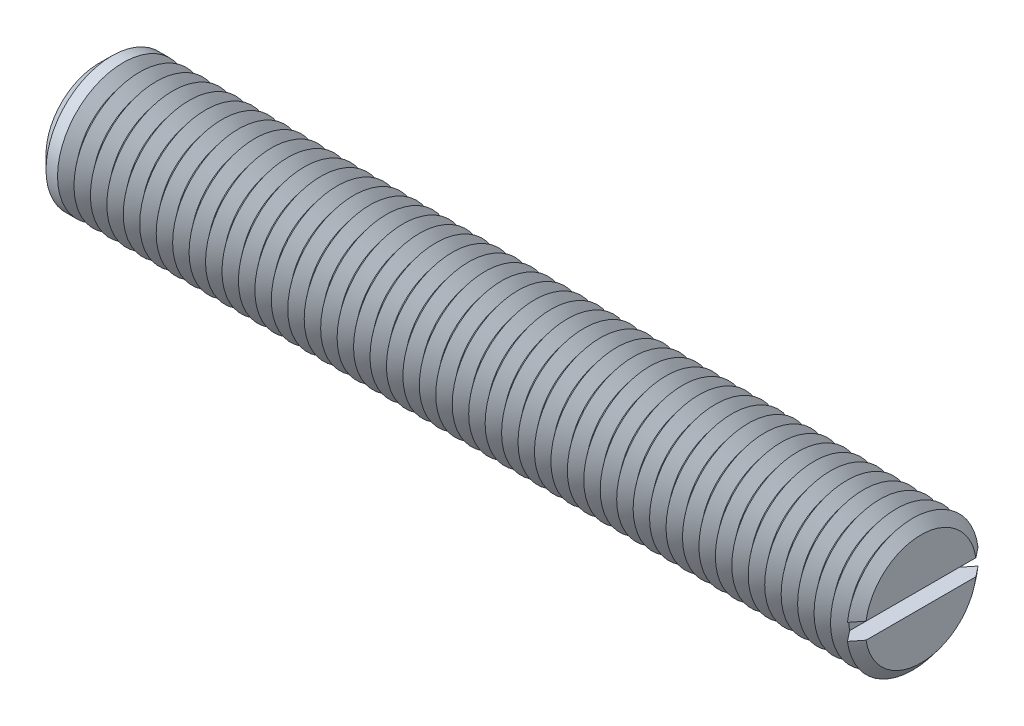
ISO-10303-21;
HEADER;
FILE_DESCRIPTION(('STEP AP214'),'2;1');
FILE_NAME('part.step','',(''),(''),'','','');
FILE_SCHEMA(('AUTOMOTIVE_DESIGN { 1 0 10303 214 1 1 1 1 }'));
ENDSEC;
DATA;
#1=APPLICATION_CONTEXT('core data for automotive mechanical design processes');
#2=APPLICATION_PROTOCOL_DEFINITION('international standard','automotive_design',2000,#1);
#3=PRODUCT_CONTEXT('',#1,'mechanical');
#4=PRODUCT('Part','Part','',(#3));
#5=PRODUCT_RELATED_PRODUCT_CATEGORY('part','',(#4));
#6=PRODUCT_DEFINITION_FORMATION('','',#4);
#7=PRODUCT_DEFINITION_CONTEXT('part definition',#1,'design');
#8=PRODUCT_DEFINITION('design','',#6,#7);
#9=PRODUCT_DEFINITION_SHAPE('','',#8);
#10=(LENGTH_UNIT() NAMED_UNIT(*) SI_UNIT(.MILLI.,.METRE.));
#11=(NAMED_UNIT(*) PLANE_ANGLE_UNIT() SI_UNIT($,.RADIAN.));
#12=(NAMED_UNIT(*) SI_UNIT($,.STERADIAN.) SOLID_ANGLE_UNIT());
#13=UNCERTAINTY_MEASURE_WITH_UNIT(LENGTH_MEASURE(1.E-05),#10,'distance_accuracy_value','');
#14=(GEOMETRIC_REPRESENTATION_CONTEXT(3) GLOBAL_UNCERTAINTY_ASSIGNED_CONTEXT((#13)) GLOBAL_UNIT_ASSIGNED_CONTEXT((#10,
#11,#12)) REPRESENTATION_CONTEXT('',''));
#15=CARTESIAN_POINT('',(0.,0.,0.));
#16=DIRECTION('',(0.,0.,1.));
#17=DIRECTION('',(1.,0.,0.));
#18=AXIS2_PLACEMENT_3D('',#15,#16,#17);
#19=CARTESIAN_POINT('',(49.,0.,0.));
#20=DIRECTION('',(1.,0.,0.));
#21=DIRECTION('',(0.,0.,-1.));
#22=AXIS2_PLACEMENT_3D('',#19,#20,#21);
#23=CONICAL_SURFACE('',#22,8.,0.895664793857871);
#24=CARTESIAN_POINT('',(49.,0.,0.));
#25=DIRECTION('',(-1.,0.,0.));
#26=DIRECTION('',(0.,0.,1.));
#27=AXIS2_PLACEMENT_3D('',#24,#25,#26);
#28=CIRCLE('',#27,8.);
#29=CARTESIAN_POINT('',(49.,-1.,-7.93725393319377));
#30=VERTEX_POINT('',#29);
#31=CARTESIAN_POINT('',(49.,-1.,7.93725393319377));
#32=VERTEX_POINT('',#31);
#33=EDGE_CURVE('E117',#30,#32,#28,.T.);
#34=ORIENTED_EDGE('',*,*,#33,.T.);
#35=CARTESIAN_POINT('',(56.6137872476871,-1.,-17.4810381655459));
#36=CARTESIAN_POINT('',(56.0731000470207,-1.,-16.8046018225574));
#37=CARTESIAN_POINT('',(55.5324624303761,-1.,-16.1281258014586));
#38=CARTESIAN_POINT('',(54.4513425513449,-1.,-14.7749910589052));
#39=CARTESIAN_POINT('',(53.9108602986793,-1.,-14.0983323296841));
#40=CARTESIAN_POINT('',(52.8295593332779,-1.,-12.7440423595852));
#41=CARTESIAN_POINT('',(52.2887409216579,-1.,-12.0664108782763));
#42=CARTESIAN_POINT('',(51.2075665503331,-1.,-10.7108366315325));
#43=CARTESIAN_POINT('',(50.6672105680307,-1.,-10.0328938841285));
#44=CARTESIAN_POINT('',(49.8866021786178,-1.,-9.05235403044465));
#45=CARTESIAN_POINT('',(49.6460332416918,-1.,-8.75000893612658));
#46=CARTESIAN_POINT('',(49.1651110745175,-1.,-8.14514467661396));
#47=CARTESIAN_POINT('',(48.9247578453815,-1.,-7.84262551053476));
#48=CARTESIAN_POINT('',(48.4443170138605,-1.,-7.23730074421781));
#49=CARTESIAN_POINT('',(48.2042294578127,-1.,-6.93449510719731));
#50=CARTESIAN_POINT('',(47.7244992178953,-1.,-6.3285404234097));
#51=CARTESIAN_POINT('',(47.4848565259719,-1.,-6.02539138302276));
#52=CARTESIAN_POINT('',(47.0064209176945,-1.,-5.41876829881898));
#53=CARTESIAN_POINT('',(46.7676275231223,-1.,-5.1152946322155));
#54=CARTESIAN_POINT('',(46.291132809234,-1.,-4.50745556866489));
#55=CARTESIAN_POINT('',(46.0534315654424,-1.,-4.20309011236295));
#56=CARTESIAN_POINT('',(45.6984723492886,-1.,-3.74537358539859));
#57=CARTESIAN_POINT('',(45.580434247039,-1.,-3.59262786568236));
#58=CARTESIAN_POINT('',(45.3451171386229,-1.,-3.28655323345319));
#59=CARTESIAN_POINT('',(45.2278381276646,-1.,-3.1332243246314));
#60=CARTESIAN_POINT('',(44.9944317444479,-1.,-2.82571819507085));
#61=CARTESIAN_POINT('',(44.8783042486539,-1.,-2.67154106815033));
#62=CARTESIAN_POINT('',(44.6478553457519,-1.,-2.36184450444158));
#63=CARTESIAN_POINT('',(44.5335338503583,-1.,-2.2063251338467));
#64=CARTESIAN_POINT('',(44.3956998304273,-1.,-2.01476175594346));
#65=CARTESIAN_POINT('',(44.3706709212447,-1.,-1.97980928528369));
#66=CARTESIAN_POINT('',(44.3208007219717,-1.,-1.90977040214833));
#67=CARTESIAN_POINT('',(44.2959594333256,-1.,-1.87468398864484));
#68=CARTESIAN_POINT('',(44.2217527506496,-1.,-1.7691914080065));
#69=CARTESIAN_POINT('',(44.1727089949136,-1.,-1.69855807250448));
#70=CARTESIAN_POINT('',(44.0751159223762,-1.,-1.5554955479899));
#71=CARTESIAN_POINT('',(44.0265831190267,-1.,-1.4830550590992));
#72=CARTESIAN_POINT('',(43.9312399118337,-1.,-1.33706835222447));
#73=CARTESIAN_POINT('',(43.8844290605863,-1.,-1.2635224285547));
#74=CARTESIAN_POINT('',(43.7926759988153,-1.,-1.11379484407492));
#75=CARTESIAN_POINT('',(43.7477706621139,-1.,-1.03759043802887));
#76=CARTESIAN_POINT('',(43.661907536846,-1.,-0.882780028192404));
#77=CARTESIAN_POINT('',(43.6209558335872,-1.,-0.804170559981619));
#78=CARTESIAN_POINT('',(43.5647846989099,-1.,-0.684500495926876));
#79=CARTESIAN_POINT('',(43.5470539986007,-1.,-0.644631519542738));
#80=CARTESIAN_POINT('',(43.5136729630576,-1.,-0.564036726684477));
#81=CARTESIAN_POINT('',(43.4980230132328,-1.,-0.523310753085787));
#82=CARTESIAN_POINT('',(43.4551526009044,-1.,-0.399956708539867));
#83=CARTESIAN_POINT('',(43.4318433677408,-1.,-0.31581601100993));
#84=CARTESIAN_POINT('',(43.4098657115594,-1.,-0.193542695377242));
#85=CARTESIAN_POINT('',(43.4047261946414,-1.,-0.156548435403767));
#86=CARTESIAN_POINT('',(43.3976757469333,-1.,-0.0822397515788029));
#87=CARTESIAN_POINT('',(43.3957650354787,-1.,-0.0449253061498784));
#88=CARTESIAN_POINT('',(43.3953106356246,-1.,0.0296935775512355));
#89=CARTESIAN_POINT('',(43.3967642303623,-1.,0.0669979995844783));
#90=CARTESIAN_POINT('',(43.402929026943,-1.,0.141334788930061));
#91=CARTESIAN_POINT('',(43.4076406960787,-1.,0.178367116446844));
#92=CARTESIAN_POINT('',(43.4224195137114,-1.,0.266117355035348));
#93=CARTESIAN_POINT('',(43.4338513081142,-1.,0.316604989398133));
#94=CARTESIAN_POINT('',(43.4613106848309,-1.,0.416309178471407));
#95=CARTESIAN_POINT('',(43.4773414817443,-1.,0.465524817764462));
#96=CARTESIAN_POINT('',(43.5130409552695,-1.,0.563049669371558));
#97=CARTESIAN_POINT('',(43.5327381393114,-1.,0.611348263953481));
#98=CARTESIAN_POINT('',(43.5747706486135,-1.,0.706748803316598));
#99=CARTESIAN_POINT('',(43.5971051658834,-1.,0.753851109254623));
#100=CARTESIAN_POINT('',(43.6464135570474,-1.,0.852405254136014));
#101=CARTESIAN_POINT('',(43.6736257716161,-1.,0.903736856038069));
#102=CARTESIAN_POINT('',(43.7298407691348,-1.,1.00541472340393));
#103=CARTESIAN_POINT('',(43.7588439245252,-1.,1.05576078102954));
#104=CARTESIAN_POINT('',(43.8478642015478,-1.,1.20570300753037));
#105=CARTESIAN_POINT('',(43.909851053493,-1.,1.30412495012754));
#106=CARTESIAN_POINT('',(44.037021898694,-1.,1.49921478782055));
#107=CARTESIAN_POINT('',(44.1022138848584,-1.,1.595877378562));
#108=CARTESIAN_POINT('',(44.2345096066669,-1.,1.78781770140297));
#109=CARTESIAN_POINT('',(44.3016124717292,-1.,1.88309603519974));
#110=CARTESIAN_POINT('',(44.4371969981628,-1.,2.07285006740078));
#111=CARTESIAN_POINT('',(44.5056803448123,-1.,2.16732455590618));
#112=CARTESIAN_POINT('',(44.6435598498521,-1.,2.35561985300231));
#113=CARTESIAN_POINT('',(44.7129561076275,-1.,2.44944058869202));
#114=CARTESIAN_POINT('',(44.8522867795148,-1.,2.63643541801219));
#115=CARTESIAN_POINT('',(44.9222200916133,-1.,2.72961033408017));
#116=CARTESIAN_POINT('',(45.0625737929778,-1.,2.91558674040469));
#117=CARTESIAN_POINT('',(45.1329941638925,-1.,3.00838824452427));
#118=CARTESIAN_POINT('',(45.3434401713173,-1.,3.28457080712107));
#119=CARTESIAN_POINT('',(45.4840068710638,-1.,3.46753938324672));
#120=CARTESIAN_POINT('',(45.7660473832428,-1.,3.83277652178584));
#121=CARTESIAN_POINT('',(45.9075212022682,-1.,4.01504507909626));
#122=CARTESIAN_POINT('',(46.3328445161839,-1.,4.5611663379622));
#123=CARTESIAN_POINT('',(46.6175870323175,-1.,4.92432312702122));
#124=CARTESIAN_POINT('',(47.1884502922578,-1.,5.64994266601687));
#125=CARTESIAN_POINT('',(47.4745718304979,-1.,6.01240478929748));
#126=CARTESIAN_POINT('',(48.0475166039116,-1.,6.73676512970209));
#127=CARTESIAN_POINT('',(48.3343398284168,-1.,7.09866335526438));
#128=CARTESIAN_POINT('',(48.9076446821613,-1.,7.82112227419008));
#129=CARTESIAN_POINT('',(49.1941251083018,-1.,8.18168392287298));
#130=CARTESIAN_POINT('',(49.7673842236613,-1.,8.90257236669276));
#131=CARTESIAN_POINT('',(50.0541629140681,-1.,9.26289916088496));
#132=CARTESIAN_POINT('',(50.9146958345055,-1.,10.3434977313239));
#133=CARTESIAN_POINT('',(51.4887564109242,-1.,11.0635255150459));
#134=CARTESIAN_POINT('',(52.4416309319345,-1.,12.2579358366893));
#135=CARTESIAN_POINT('',(52.8203198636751,-1.,12.7324181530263));
#136=CARTESIAN_POINT('',(53.5778600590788,-1.,13.6812951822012));
#137=CARTESIAN_POINT('',(53.9567113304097,-1.,14.155689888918));
#138=CARTESIAN_POINT('',(54.7152320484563,-1.,15.1052923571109));
#139=CARTESIAN_POINT('',(55.0949016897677,-1.,15.5804999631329));
#140=CARTESIAN_POINT('',(55.8543004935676,-1.,16.5308253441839));
#141=CARTESIAN_POINT('',(56.2340296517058,-1.,17.005943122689));
#142=CARTESIAN_POINT('',(56.6137872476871,-1.,17.4810381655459));
#143=B_SPLINE_CURVE_WITH_KNOTS('',3,(#35,#36,#37,#38,#39,#40,#41,#42,#43,#44,#45,#46,#47,#48,
#49,#50,#51,#52,#53,#54,#55,#56,#57,#58,#59,#60,#61,#62,#63,#64,#65,#66,#67,#68,#69,#70,#71,#72,
#73,#74,#75,#76,#77,#78,#79,#80,#81,#82,#83,#84,#85,#86,#87,#88,#89,#90,#91,#92,#93,#94,#95,#96,
#97,#98,#99,#100,#101,#102,#103,#104,#105,#106,#107,#108,#109,#110,#111,#112,#113,#114,#115,
#116,#117,#118,#119,#120,#121,#122,#123,#124,#125,#126,#127,#128,#129,#130,#131,#132,#133,#134,
#135,#136,#137,#138,#139,#140,#141,#142),.UNSPECIFIED.,.F.,.F.,(4,2,2,2,2,2,2,2,2,2,2,2,2,2,2,2,
2,2,2,2,2,2,2,2,2,2,2,2,2,2,2,2,2,2,2,2,2,2,2,2,2,2,2,2,2,2,2,2,2,2,2,2,2,4),(0.,
2.59791825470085,5.19597381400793,7.79693910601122,10.3977690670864,11.5568952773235,
12.7160274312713,13.8753371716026,15.0346257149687,16.1931009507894,17.3516551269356,
17.9307722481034,18.5098857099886,19.0889363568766,19.6679586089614,19.7969273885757,
19.9258971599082,20.1838595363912,20.4454304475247,20.7069329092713,20.9722220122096,
21.2379131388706,21.3687577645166,21.4996265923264,21.7602408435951,21.8721711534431,
21.9841090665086,22.0959566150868,22.2078202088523,22.362827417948,22.5179432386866,
22.6743197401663,22.8306484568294,23.0048946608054,23.1791772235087,23.5280071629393,
23.8777561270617,24.2273482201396,24.5773965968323,24.927483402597,25.276981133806,
25.6264657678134,26.3186514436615,27.0108421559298,28.3952670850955,29.7806179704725,
31.1659479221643,32.5474981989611,33.9290539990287,36.6916375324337,38.5128593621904,
40.3341796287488,42.1589376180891,43.98359654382),.UNSPECIFIED.);
#144=CARTESIAN_POINT('',(48.,-1.,6.67652652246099));
#145=VERTEX_POINT('',#144);
#146=EDGE_CURVE('E109',#145,#32,#143,.T.);
#147=ORIENTED_EDGE('',*,*,#146,.F.);
#148=CARTESIAN_POINT('',(48.,0.,0.));
#149=DIRECTION('',(-1.,0.,0.));
#150=DIRECTION('',(0.,0.,1.));
#151=AXIS2_PLACEMENT_3D('',#148,#149,#150);
#152=CIRCLE('',#151,6.75100040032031);
#153=CARTESIAN_POINT('',(48.,-1.,-6.67652652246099));
#154=VERTEX_POINT('',#153);
#155=EDGE_CURVE('E608',#154,#145,#152,.T.);
#156=ORIENTED_EDGE('',*,*,#155,.F.);
#157=EDGE_CURVE('E58',#30,#154,#143,.T.);
#158=ORIENTED_EDGE('',*,*,#157,.F.);
#159=EDGE_LOOP('',(#34,#147,#156,#158));
#160=FACE_BOUND('',#159,.T.);
#161=ADVANCED_FACE('F37',(#160),#23,.T.);
#162=CARTESIAN_POINT('',(49.,1.,7.93725393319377));
#163=VERTEX_POINT('',#162);
#164=CARTESIAN_POINT('',(49.,1.,-7.93725393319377));
#165=VERTEX_POINT('',#164);
#166=EDGE_CURVE('E100',#163,#165,#28,.T.);
#167=ORIENTED_EDGE('',*,*,#166,.T.);
#168=CARTESIAN_POINT('',(56.6137872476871,1.,17.4810381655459));
#169=CARTESIAN_POINT('',(56.0731000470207,1.,16.8046018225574));
#170=CARTESIAN_POINT('',(55.5324624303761,1.,16.1281258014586));
#171=CARTESIAN_POINT('',(54.4513425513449,1.,14.7749910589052));
#172=CARTESIAN_POINT('',(53.9108602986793,1.,14.0983323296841));
#173=CARTESIAN_POINT('',(52.8295593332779,1.,12.7440423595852));
#174=CARTESIAN_POINT('',(52.2887409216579,1.,12.0664108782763));
#175=CARTESIAN_POINT('',(51.2075665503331,1.,10.7108366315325));
#176=CARTESIAN_POINT('',(50.6672105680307,1.,10.0328938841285));
#177=CARTESIAN_POINT('',(49.8866021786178,1.,9.05235403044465));
#178=CARTESIAN_POINT('',(49.6460332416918,1.,8.75000893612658));
#179=CARTESIAN_POINT('',(49.1651110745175,1.,8.14514467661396));
#180=CARTESIAN_POINT('',(48.9247578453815,1.,7.84262551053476));
#181=CARTESIAN_POINT('',(48.4443170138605,1.,7.23730074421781));
#182=CARTESIAN_POINT('',(48.2042294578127,1.,6.93449510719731));
#183=CARTESIAN_POINT('',(47.7244992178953,1.,6.3285404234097));
#184=CARTESIAN_POINT('',(47.4848565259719,1.,6.02539138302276));
#185=CARTESIAN_POINT('',(47.0064209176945,1.,5.41876829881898));
#186=CARTESIAN_POINT('',(46.7676275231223,1.,5.1152946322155));
#187=CARTESIAN_POINT('',(46.291132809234,1.,4.50745556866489));
#188=CARTESIAN_POINT('',(46.0534315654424,1.,4.20309011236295));
#189=CARTESIAN_POINT('',(45.6984723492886,1.,3.74537358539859));
#190=CARTESIAN_POINT('',(45.580434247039,1.,3.59262786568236));
#191=CARTESIAN_POINT('',(45.3451171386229,1.,3.28655323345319));
#192=CARTESIAN_POINT('',(45.2278381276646,1.,3.1332243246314));
#193=CARTESIAN_POINT('',(44.9944317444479,1.,2.82571819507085));
#194=CARTESIAN_POINT('',(44.8783042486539,1.,2.67154106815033));
#195=CARTESIAN_POINT('',(44.6478553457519,1.,2.36184450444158));
#196=CARTESIAN_POINT('',(44.5335338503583,1.,2.2063251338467));
#197=CARTESIAN_POINT('',(44.3956998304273,1.,2.01476175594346));
#198=CARTESIAN_POINT('',(44.3706709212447,1.,1.97980928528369));
#199=CARTESIAN_POINT('',(44.3208007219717,1.,1.90977040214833));
#200=CARTESIAN_POINT('',(44.2959594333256,1.,1.87468398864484));
#201=CARTESIAN_POINT('',(44.2217527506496,1.,1.7691914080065));
#202=CARTESIAN_POINT('',(44.1727089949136,1.,1.69855807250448));
#203=CARTESIAN_POINT('',(44.0751159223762,1.,1.5554955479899));
#204=CARTESIAN_POINT('',(44.0265831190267,1.,1.4830550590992));
#205=CARTESIAN_POINT('',(43.9312399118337,1.,1.33706835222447));
#206=CARTESIAN_POINT('',(43.8844290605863,1.,1.2635224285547));
#207=CARTESIAN_POINT('',(43.7926759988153,1.,1.11379484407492));
#208=CARTESIAN_POINT('',(43.7477706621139,1.,1.03759043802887));
#209=CARTESIAN_POINT('',(43.661907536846,1.,0.882780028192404));
#210=CARTESIAN_POINT('',(43.6209558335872,1.,0.804170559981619));
#211=CARTESIAN_POINT('',(43.5647846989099,1.,0.684500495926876));
#212=CARTESIAN_POINT('',(43.5470539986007,1.,0.644631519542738));
#213=CARTESIAN_POINT('',(43.5136729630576,1.,0.564036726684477));
#214=CARTESIAN_POINT('',(43.4980230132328,1.,0.523310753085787));
#215=CARTESIAN_POINT('',(43.4551526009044,1.,0.399956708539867));
#216=CARTESIAN_POINT('',(43.4318433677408,1.,0.31581601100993));
#217=CARTESIAN_POINT('',(43.4098657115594,1.,0.193542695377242));
#218=CARTESIAN_POINT('',(43.4047261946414,1.,0.156548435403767));
#219=CARTESIAN_POINT('',(43.3976757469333,1.,0.0822397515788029));
#220=CARTESIAN_POINT('',(43.3957650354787,1.,0.0449253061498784));
#221=CARTESIAN_POINT('',(43.3953106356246,1.,-0.0296935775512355));
#222=CARTESIAN_POINT('',(43.3967642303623,1.,-0.0669979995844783));
#223=CARTESIAN_POINT('',(43.402929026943,1.,-0.141334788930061));
#224=CARTESIAN_POINT('',(43.4076406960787,1.,-0.178367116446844));
#225=CARTESIAN_POINT('',(43.4224195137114,1.,-0.266117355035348));
#226=CARTESIAN_POINT('',(43.4338513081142,1.,-0.316604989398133));
#227=CARTESIAN_POINT('',(43.4613106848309,1.,-0.416309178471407));
#228=CARTESIAN_POINT('',(43.4773414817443,1.,-0.465524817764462));
#229=CARTESIAN_POINT('',(43.5130409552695,1.,-0.563049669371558));
#230=CARTESIAN_POINT('',(43.5327381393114,1.,-0.611348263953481));
#231=CARTESIAN_POINT('',(43.5747706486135,1.,-0.706748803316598));
#232=CARTESIAN_POINT('',(43.5971051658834,1.,-0.753851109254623));
#233=CARTESIAN_POINT('',(43.6464135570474,1.,-0.852405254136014));
#234=CARTESIAN_POINT('',(43.6736257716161,1.,-0.903736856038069));
#235=CARTESIAN_POINT('',(43.7298407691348,1.,-1.00541472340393));
#236=CARTESIAN_POINT('',(43.7588439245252,1.,-1.05576078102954));
#237=CARTESIAN_POINT('',(43.8478642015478,1.,-1.20570300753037));
#238=CARTESIAN_POINT('',(43.909851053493,1.,-1.30412495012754));
#239=CARTESIAN_POINT('',(44.037021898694,1.,-1.49921478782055));
#240=CARTESIAN_POINT('',(44.1022138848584,1.,-1.595877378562));
#241=CARTESIAN_POINT('',(44.2345096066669,1.,-1.78781770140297));
#242=CARTESIAN_POINT('',(44.3016124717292,1.,-1.88309603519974));
#243=CARTESIAN_POINT('',(44.4371969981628,1.,-2.07285006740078));
#244=CARTESIAN_POINT('',(44.5056803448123,1.,-2.16732455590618));
#245=CARTESIAN_POINT('',(44.6435598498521,1.,-2.35561985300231));
#246=CARTESIAN_POINT('',(44.7129561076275,1.,-2.44944058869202));
#247=CARTESIAN_POINT('',(44.8522867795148,1.,-2.63643541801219));
#248=CARTESIAN_POINT('',(44.9222200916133,1.,-2.72961033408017));
#249=CARTESIAN_POINT('',(45.0625737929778,1.,-2.91558674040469));
#250=CARTESIAN_POINT('',(45.1329941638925,1.,-3.00838824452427));
#251=CARTESIAN_POINT('',(45.3434401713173,1.,-3.28457080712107));
#252=CARTESIAN_POINT('',(45.4840068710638,1.,-3.46753938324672));
#253=CARTESIAN_POINT('',(45.7660473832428,1.,-3.83277652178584));
#254=CARTESIAN_POINT('',(45.9075212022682,1.,-4.01504507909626));
#255=CARTESIAN_POINT('',(46.3328445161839,1.,-4.5611663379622));
#256=CARTESIAN_POINT('',(46.6175870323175,1.,-4.92432312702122));
#257=CARTESIAN_POINT('',(47.1884502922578,1.,-5.64994266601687));
#258=CARTESIAN_POINT('',(47.4745718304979,1.,-6.01240478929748));
#259=CARTESIAN_POINT('',(48.0475166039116,1.,-6.73676512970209));
#260=CARTESIAN_POINT('',(48.3343398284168,1.,-7.09866335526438));
#261=CARTESIAN_POINT('',(48.9076446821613,1.,-7.82112227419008));
#262=CARTESIAN_POINT('',(49.1941251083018,1.,-8.18168392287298));
#263=CARTESIAN_POINT('',(49.7673842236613,1.,-8.90257236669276));
#264=CARTESIAN_POINT('',(50.0541629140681,1.,-9.26289916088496));
#265=CARTESIAN_POINT('',(50.9146958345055,1.,-10.3434977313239));
#266=CARTESIAN_POINT('',(51.4887564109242,1.,-11.0635255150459));
#267=CARTESIAN_POINT('',(52.4416309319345,1.,-12.2579358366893));
#268=CARTESIAN_POINT('',(52.8203198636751,1.,-12.7324181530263));
#269=CARTESIAN_POINT('',(53.5778600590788,1.,-13.6812951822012));
#270=CARTESIAN_POINT('',(53.9567113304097,1.,-14.155689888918));
#271=CARTESIAN_POINT('',(54.7152320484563,1.,-15.1052923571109));
#272=CARTESIAN_POINT('',(55.0949016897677,1.,-15.5804999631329));
#273=CARTESIAN_POINT('',(55.8543004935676,1.,-16.5308253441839));
#274=CARTESIAN_POINT('',(56.2340296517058,1.,-17.005943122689));
#275=CARTESIAN_POINT('',(56.6137872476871,1.,-17.4810381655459));
#276=B_SPLINE_CURVE_WITH_KNOTS('',3,(#168,#169,#170,#171,#172,#173,#174,#175,#176,#177,#178,
#179,#180,#181,#182,#183,#184,#185,#186,#187,#188,#189,#190,#191,#192,#193,#194,#195,#196,#197,
#198,#199,#200,#201,#202,#203,#204,#205,#206,#207,#208,#209,#210,#211,#212,#213,#214,#215,#216,
#217,#218,#219,#220,#221,#222,#223,#224,#225,#226,#227,#228,#229,#230,#231,#232,#233,#234,#235,
#236,#237,#238,#239,#240,#241,#242,#243,#244,#245,#246,#247,#248,#249,#250,#251,#252,#253,#254,
#255,#256,#257,#258,#259,#260,#261,#262,#263,#264,#265,#266,#267,#268,#269,#270,#271,#272,#273,
#274,#275),.UNSPECIFIED.,.F.,.F.,(4,2,2,2,2,2,2,2,2,2,2,2,2,2,2,2,2,2,2,2,2,2,2,2,2,2,2,2,2,2,2,
2,2,2,2,2,2,2,2,2,2,2,2,2,2,2,2,2,2,2,2,2,2,4),(0.,2.59791825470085,5.19597381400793,
7.79693910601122,10.3977690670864,11.5568952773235,12.7160274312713,13.8753371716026,
15.0346257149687,16.1931009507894,17.3516551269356,17.9307722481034,18.5098857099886,
19.0889363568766,19.6679586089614,19.7969273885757,19.9258971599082,20.1838595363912,
20.4454304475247,20.7069329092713,20.9722220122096,21.2379131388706,21.3687577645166,
21.4996265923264,21.7602408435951,21.8721711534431,21.9841090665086,22.0959566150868,
22.2078202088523,22.362827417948,22.5179432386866,22.6743197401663,22.8306484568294,
23.0048946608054,23.1791772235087,23.5280071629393,23.8777561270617,24.2273482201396,
24.5773965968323,24.927483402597,25.276981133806,25.6264657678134,26.3186514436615,
27.0108421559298,28.3952670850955,29.7806179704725,31.1659479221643,32.5474981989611,
33.9290539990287,36.6916375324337,38.5128593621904,40.3341796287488,42.1589376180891,
43.98359654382),.UNSPECIFIED.);
#277=CARTESIAN_POINT('',(48.,1.,-6.67652652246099));
#278=VERTEX_POINT('',#277);
#279=EDGE_CURVE('E110',#278,#165,#276,.T.);
#280=ORIENTED_EDGE('',*,*,#279,.F.);
#281=CARTESIAN_POINT('',(48.,1.,6.67652652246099));
#282=VERTEX_POINT('',#281);
#283=EDGE_CURVE('E103',#282,#278,#152,.T.);
#284=ORIENTED_EDGE('',*,*,#283,.F.);
#285=EDGE_CURVE('E97',#163,#282,#276,.T.);
#286=ORIENTED_EDGE('',*,*,#285,.F.);
#287=EDGE_LOOP('',(#167,#280,#284,#286));
#288=FACE_BOUND('',#287,.T.);
#289=ADVANCED_FACE('F99',(#288),#23,.T.);
#290=CARTESIAN_POINT('',(48.,0.,0.));
#291=DIRECTION('',(-1.,0.,0.));
#292=DIRECTION('',(0.,0.,1.));
#293=AXIS2_PLACEMENT_3D('',#290,#291,#292);
#294=CONICAL_SURFACE('',#293,6.75100040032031,0.895664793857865);
#295=CARTESIAN_POINT('',(47.,0.,0.));
#296=DIRECTION('',(-1.,0.,0.));
#297=DIRECTION('',(0.,0.,1.));
#298=AXIS2_PLACEMENT_3D('',#295,#296,#297);
#299=CIRCLE('',#298,8.);
#300=CARTESIAN_POINT('',(47.,0.,8.));
#301=VERTEX_POINT('',#300);
#302=EDGE_CURVE('E595',#301,#301,#299,.T.);
#303=ORIENTED_EDGE('',*,*,#302,.F.);
#304=EDGE_LOOP('',(#303));
#305=FACE_BOUND('',#304,.T.);
#306=ORIENTED_EDGE('',*,*,#283,.T.);
#307=EDGE_CURVE('E603',#278,#154,#152,.T.);
#308=ORIENTED_EDGE('',*,*,#307,.T.);
#309=ORIENTED_EDGE('',*,*,#155,.T.);
#310=EDGE_CURVE('E602',#145,#282,#152,.T.);
#311=ORIENTED_EDGE('',*,*,#310,.T.);
#312=EDGE_LOOP('',(#306,#308,#309,#311));
#313=FACE_BOUND('',#312,.T.);
#314=ADVANCED_FACE('F168',(#305,#313),#294,.T.);
#315=CARTESIAN_POINT('',(50.,0.,0.));
#316=DIRECTION('',(1.,0.,0.));
#317=DIRECTION('',(0.,0.,-1.));
#318=AXIS2_PLACEMENT_3D('',#315,#316,#317);
#319=PLANE('',#318);
#320=CARTESIAN_POINT('',(50.,0.,0.));
#321=DIRECTION('',(-1.,0.,0.));
#322=DIRECTION('',(0.,0.,1.));
#323=AXIS2_PLACEMENT_3D('',#320,#321,#322);
#324=CIRCLE('',#323,6.75100040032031);
#325=CARTESIAN_POINT('',(50.,1.,6.67652652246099));
#326=VERTEX_POINT('',#325);
#327=CARTESIAN_POINT('',(50.,1.,-6.67652652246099));
#328=VERTEX_POINT('',#327);
#329=EDGE_CURVE('E160',#326,#328,#324,.T.);
#330=ORIENTED_EDGE('',*,*,#329,.F.);
#331=DIRECTION('',(0.,0.,1.));
#332=VECTOR('',#331,1.);
#333=CARTESIAN_POINT('',(50.,1.,0.));
#334=LINE('',#333,#332);
#335=EDGE_CURVE('E122',#328,#326,#334,.T.);
#336=ORIENTED_EDGE('',*,*,#335,.F.);
#337=EDGE_LOOP('',(#330,#336));
#338=FACE_BOUND('',#337,.T.);
#339=ADVANCED_FACE('F172',(#338),#319,.T.);
#340=CARTESIAN_POINT('',(50.,-1.,-6.67652652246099));
#341=VERTEX_POINT('',#340);
#342=CARTESIAN_POINT('',(50.,-1.,6.67652652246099));
#343=VERTEX_POINT('',#342);
#344=EDGE_CURVE('E66',#341,#343,#324,.T.);
#345=ORIENTED_EDGE('',*,*,#344,.F.);
#346=DIRECTION('',(0.,0.,-1.));
#347=VECTOR('',#346,1.);
#348=CARTESIAN_POINT('',(50.,-1.,0.));
#349=LINE('',#348,#347);
#350=EDGE_CURVE('E136',#343,#341,#349,.T.);
#351=ORIENTED_EDGE('',*,*,#350,.F.);
#352=EDGE_LOOP('',(#345,#351));
#353=FACE_BOUND('',#352,.T.);
#354=ADVANCED_FACE('F200',(#353),#319,.T.);
#355=CARTESIAN_POINT('',(50.,0.,0.));
#356=DIRECTION('',(-1.,0.,0.));
#357=DIRECTION('',(0.,0.,1.));
#358=AXIS2_PLACEMENT_3D('',#355,#356,#357);
#359=CONICAL_SURFACE('',#358,6.75100040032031,0.895664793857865);
#360=ORIENTED_EDGE('',*,*,#166,.F.);
#361=CARTESIAN_POINT('',(41.3862127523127,1.,-17.4810381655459));
#362=CARTESIAN_POINT('',(41.9268999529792,1.,-16.8046018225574));
#363=CARTESIAN_POINT('',(42.4675375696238,1.,-16.1281258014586));
#364=CARTESIAN_POINT('',(43.548657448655,1.,-14.7749910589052));
#365=CARTESIAN_POINT('',(44.0891397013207,1.,-14.0983323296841));
#366=CARTESIAN_POINT('',(45.170440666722,1.,-12.7440423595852));
#367=CARTESIAN_POINT('',(45.7112590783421,1.,-12.0664108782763));
#368=CARTESIAN_POINT('',(46.7924334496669,1.,-10.7108366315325));
#369=CARTESIAN_POINT('',(47.3327894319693,1.,-10.0328938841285));
#370=CARTESIAN_POINT('',(48.1133978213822,1.,-9.05235403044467));
#371=CARTESIAN_POINT('',(48.3539667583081,1.,-8.7500089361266));
#372=CARTESIAN_POINT('',(48.8348889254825,1.,-8.14514467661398));
#373=CARTESIAN_POINT('',(49.0752421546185,1.,-7.84262551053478));
#374=CARTESIAN_POINT('',(49.5556829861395,1.,-7.23730074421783));
#375=CARTESIAN_POINT('',(49.7957705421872,1.,-6.93449510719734));
#376=CARTESIAN_POINT('',(50.2755007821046,1.,-6.32854042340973));
#377=CARTESIAN_POINT('',(50.5151434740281,1.,-6.02539138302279));
#378=CARTESIAN_POINT('',(50.9935790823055,1.,-5.41876829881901));
#379=CARTESIAN_POINT('',(51.2323724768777,1.,-5.11529463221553));
#380=CARTESIAN_POINT('',(51.708867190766,1.,-4.50745556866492));
#381=CARTESIAN_POINT('',(51.9465684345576,1.,-4.20309011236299));
#382=CARTESIAN_POINT('',(52.3015276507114,1.,-3.74537358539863));
#383=CARTESIAN_POINT('',(52.419565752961,1.,-3.5926278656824));
#384=CARTESIAN_POINT('',(52.6548828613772,1.,-3.28655323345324));
#385=CARTESIAN_POINT('',(52.7721618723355,1.,-3.13322432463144));
#386=CARTESIAN_POINT('',(53.0055682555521,1.,-2.82571819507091));
#387=CARTESIAN_POINT('',(53.1216957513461,1.,-2.67154106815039));
#388=CARTESIAN_POINT('',(53.3521446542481,1.,-2.36184450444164));
#389=CARTESIAN_POINT('',(53.4664661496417,1.,-2.20632513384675));
#390=CARTESIAN_POINT('',(53.6043001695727,1.,-2.01476175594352));
#391=CARTESIAN_POINT('',(53.6293290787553,1.,-1.97980928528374));
#392=CARTESIAN_POINT('',(53.6791992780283,1.,-1.90977040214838));
#393=CARTESIAN_POINT('',(53.7040405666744,1.,-1.8746839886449));
#394=CARTESIAN_POINT('',(53.7782472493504,1.,-1.76919140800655));
#395=CARTESIAN_POINT('',(53.8272910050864,1.,-1.69855807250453));
#396=CARTESIAN_POINT('',(53.9248840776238,1.,-1.55549554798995));
#397=CARTESIAN_POINT('',(53.9734168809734,1.,-1.48305505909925));
#398=CARTESIAN_POINT('',(54.0687600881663,1.,-1.33706835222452));
#399=CARTESIAN_POINT('',(54.1155709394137,1.,-1.26352242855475));
#400=CARTESIAN_POINT('',(54.2073240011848,1.,-1.11379484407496));
#401=CARTESIAN_POINT('',(54.2522293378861,1.,-1.03759043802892));
#402=CARTESIAN_POINT('',(54.338092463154,1.,-0.882780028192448));
#403=CARTESIAN_POINT('',(54.3790441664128,1.,-0.804170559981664));
#404=CARTESIAN_POINT('',(54.4352153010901,1.,-0.684500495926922));
#405=CARTESIAN_POINT('',(54.4529460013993,1.,-0.644631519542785));
#406=CARTESIAN_POINT('',(54.4863270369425,1.,-0.564036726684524));
#407=CARTESIAN_POINT('',(54.5019769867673,1.,-0.523310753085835));
#408=CARTESIAN_POINT('',(54.5448473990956,1.,-0.399956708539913));
#409=CARTESIAN_POINT('',(54.5681566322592,1.,-0.315816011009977));
#410=CARTESIAN_POINT('',(54.5901342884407,1.,-0.19354269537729));
#411=CARTESIAN_POINT('',(54.5952738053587,1.,-0.156548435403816));
#412=CARTESIAN_POINT('',(54.6023242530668,1.,-0.0822397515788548));
#413=CARTESIAN_POINT('',(54.6042349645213,1.,-0.0449253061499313));
#414=CARTESIAN_POINT('',(54.6046893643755,1.,0.0296935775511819));
#415=CARTESIAN_POINT('',(54.6032357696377,1.,0.066997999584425));
#416=CARTESIAN_POINT('',(54.5970709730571,1.,0.141334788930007));
#417=CARTESIAN_POINT('',(54.5923593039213,1.,0.178367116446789));
#418=CARTESIAN_POINT('',(54.5775804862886,1.,0.266117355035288));
#419=CARTESIAN_POINT('',(54.5661486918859,1.,0.31660498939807));
#420=CARTESIAN_POINT('',(54.5386893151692,1.,0.416309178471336));
#421=CARTESIAN_POINT('',(54.5226585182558,1.,0.465524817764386));
#422=CARTESIAN_POINT('',(54.4869590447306,1.,0.563049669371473));
#423=CARTESIAN_POINT('',(54.4672618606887,1.,0.611348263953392));
#424=CARTESIAN_POINT('',(54.4252293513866,1.,0.706748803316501));
#425=CARTESIAN_POINT('',(54.4028948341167,1.,0.753851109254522));
#426=CARTESIAN_POINT('',(54.3535864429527,1.,0.852405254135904));
#427=CARTESIAN_POINT('',(54.326374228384,1.,0.903736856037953));
#428=CARTESIAN_POINT('',(54.2701592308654,1.,1.0054147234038));
#429=CARTESIAN_POINT('',(54.2411560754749,1.,1.05576078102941));
#430=CARTESIAN_POINT('',(54.1521357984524,1.,1.20570300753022));
#431=CARTESIAN_POINT('',(54.0901489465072,1.,1.30412495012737));
#432=CARTESIAN_POINT('',(53.9629781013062,1.,1.49921478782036));
#433=CARTESIAN_POINT('',(53.8977861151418,1.,1.59587737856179));
#434=CARTESIAN_POINT('',(53.7654903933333,1.,1.78781770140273));
#435=CARTESIAN_POINT('',(53.698387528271,1.,1.8830960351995));
#436=CARTESIAN_POINT('',(53.5628030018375,1.,2.0728500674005));
#437=CARTESIAN_POINT('',(53.494319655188,1.,2.16732455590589));
#438=CARTESIAN_POINT('',(53.3564401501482,1.,2.355619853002));
#439=CARTESIAN_POINT('',(53.2870438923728,1.,2.4494405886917));
#440=CARTESIAN_POINT('',(53.1477132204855,1.,2.63643541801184));
#441=CARTESIAN_POINT('',(53.077779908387,1.,2.72961033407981));
#442=CARTESIAN_POINT('',(52.9374262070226,1.,2.91558674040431));
#443=CARTESIAN_POINT('',(52.8670058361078,1.,3.00838824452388));
#444=CARTESIAN_POINT('',(52.6565598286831,1.,3.28457080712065));
#445=CARTESIAN_POINT('',(52.5159931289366,1.,3.46753938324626));
#446=CARTESIAN_POINT('',(52.2339526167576,1.,3.83277652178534));
#447=CARTESIAN_POINT('',(52.0924787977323,1.,4.01504507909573));
#448=CARTESIAN_POINT('',(51.6671554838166,1.,4.56116633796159));
#449=CARTESIAN_POINT('',(51.3824129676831,1.,4.92432312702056));
#450=CARTESIAN_POINT('',(50.8115497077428,1.,5.6499426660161));
#451=CARTESIAN_POINT('',(50.5254281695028,1.,6.01240478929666));
#452=CARTESIAN_POINT('',(49.9524833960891,1.,6.73676512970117));
#453=CARTESIAN_POINT('',(49.665660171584,1.,7.09866335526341));
#454=CARTESIAN_POINT('',(49.0923553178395,1.,7.82112227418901));
#455=CARTESIAN_POINT('',(48.8058748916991,1.,8.18168392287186));
#456=CARTESIAN_POINT('',(48.2326157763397,1.,8.90257236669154));
#457=CARTESIAN_POINT('',(47.9458370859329,1.,9.26289916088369));
#458=CARTESIAN_POINT('',(47.0853041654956,1.,10.3434977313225));
#459=CARTESIAN_POINT('',(46.5112435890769,1.,11.0635255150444));
#460=CARTESIAN_POINT('',(45.5583690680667,1.,12.2579358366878));
#461=CARTESIAN_POINT('',(45.179680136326,1.,12.732418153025));
#462=CARTESIAN_POINT('',(44.422139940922,1.,13.6812951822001));
#463=CARTESIAN_POINT('',(44.043288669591,1.,14.155689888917));
#464=CARTESIAN_POINT('',(43.2847679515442,1.,15.1052923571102));
#465=CARTESIAN_POINT('',(42.9050983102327,1.,15.5804999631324));
#466=CARTESIAN_POINT('',(42.1456995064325,1.,16.5308253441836));
#467=CARTESIAN_POINT('',(41.7659703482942,1.,17.0059431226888));
#468=CARTESIAN_POINT('',(41.3862127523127,1.,17.4810381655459));
#469=B_SPLINE_CURVE_WITH_KNOTS('',3,(#361,#362,#363,#364,#365,#366,#367,#368,#369,#370,#371,
#372,#373,#374,#375,#376,#377,#378,#379,#380,#381,#382,#383,#384,#385,#386,#387,#388,#389,#390,
#391,#392,#393,#394,#395,#396,#397,#398,#399,#400,#401,#402,#403,#404,#405,#406,#407,#408,#409,
#410,#411,#412,#413,#414,#415,#416,#417,#418,#419,#420,#421,#422,#423,#424,#425,#426,#427,#428,
#429,#430,#431,#432,#433,#434,#435,#436,#437,#438,#439,#440,#441,#442,#443,#444,#445,#446,#447,
#448,#449,#450,#451,#452,#453,#454,#455,#456,#457,#458,#459,#460,#461,#462,#463,#464,#465,#466,
#467,#468),.UNSPECIFIED.,.F.,.F.,(4,2,2,2,2,2,2,2,2,2,2,2,2,2,2,2,2,2,2,2,2,2,2,2,2,2,2,2,2,2,2,
2,2,2,2,2,2,2,2,2,2,2,2,2,2,2,2,2,2,2,2,2,2,4),(0.,2.59791825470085,5.19597381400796,
7.79693910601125,10.3977690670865,11.5568952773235,12.7160274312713,13.8753371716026,
15.0346257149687,16.1931009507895,17.3516551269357,17.9307722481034,18.5098857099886,
19.0889363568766,19.6679586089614,19.7969273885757,19.9258971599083,20.1838595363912,
20.4454304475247,20.7069329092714,20.9722220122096,21.2379131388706,21.3687577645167,
21.4996265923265,21.7602408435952,21.8721711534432,21.9841090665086,22.0959566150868,
22.2078202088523,22.362827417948,22.5179432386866,22.6743197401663,22.8306484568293,
23.0048946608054,23.1791772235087,23.5280071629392,23.8777561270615,24.2273482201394,
24.577396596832,24.9274834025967,25.2769811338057,25.626465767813,26.318651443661,
27.0108421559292,28.3952670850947,29.7806179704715,31.1659479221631,32.5474981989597,
33.9290539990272,36.6916375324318,38.512859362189,40.334179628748,42.1589376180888,
43.9835965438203),.UNSPECIFIED.);
#470=EDGE_CURVE('E41',#326,#163,#469,.T.);
#471=ORIENTED_EDGE('',*,*,#470,.F.);
#472=ORIENTED_EDGE('',*,*,#329,.T.);
#473=EDGE_CURVE('E11',#165,#328,#469,.T.);
#474=ORIENTED_EDGE('',*,*,#473,.F.);
#475=EDGE_LOOP('',(#360,#471,#472,#474));
#476=FACE_BOUND('',#475,.T.);
#477=ADVANCED_FACE('F114',(#476),#359,.T.);
#478=CARTESIAN_POINT('',(50.,1.,-12.));
#479=DIRECTION('',(0.,1.,0.));
#480=DIRECTION('',(0.,0.,1.));
#481=AXIS2_PLACEMENT_3D('',#478,#479,#480);
#482=PLANE('',#481);
#483=ORIENTED_EDGE('',*,*,#470,.T.);
#484=ORIENTED_EDGE('',*,*,#285,.T.);
#485=DIRECTION('',(0.,0.,1.));
#486=VECTOR('',#485,1.);
#487=CARTESIAN_POINT('',(48.,1.,-12.));
#488=LINE('',#487,#486);
#489=EDGE_CURVE('E145',#278,#282,#488,.T.);
#490=ORIENTED_EDGE('',*,*,#489,.F.);
#491=ORIENTED_EDGE('',*,*,#279,.T.);
#492=ORIENTED_EDGE('',*,*,#473,.T.);
#493=ORIENTED_EDGE('',*,*,#335,.T.);
#494=EDGE_LOOP('',(#483,#484,#490,#491,#492,#493));
#495=FACE_BOUND('',#494,.T.);
#496=ADVANCED_FACE('F120',(#495),#482,.F.);
#497=ORIENTED_EDGE('',*,*,#33,.F.);
#498=CARTESIAN_POINT('',(41.3862127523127,-1.,17.4810381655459));
#499=CARTESIAN_POINT('',(41.9268999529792,-1.,16.8046018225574));
#500=CARTESIAN_POINT('',(42.4675375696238,-1.,16.1281258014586));
#501=CARTESIAN_POINT('',(43.548657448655,-1.,14.7749910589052));
#502=CARTESIAN_POINT('',(44.0891397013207,-1.,14.0983323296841));
#503=CARTESIAN_POINT('',(45.170440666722,-1.,12.7440423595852));
#504=CARTESIAN_POINT('',(45.7112590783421,-1.,12.0664108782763));
#505=CARTESIAN_POINT('',(46.7924334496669,-1.,10.7108366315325));
#506=CARTESIAN_POINT('',(47.3327894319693,-1.,10.0328938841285));
#507=CARTESIAN_POINT('',(48.1133978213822,-1.,9.05235403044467));
#508=CARTESIAN_POINT('',(48.3539667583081,-1.,8.7500089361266));
#509=CARTESIAN_POINT('',(48.8348889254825,-1.,8.14514467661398));
#510=CARTESIAN_POINT('',(49.0752421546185,-1.,7.84262551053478));
#511=CARTESIAN_POINT('',(49.5556829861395,-1.,7.23730074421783));
#512=CARTESIAN_POINT('',(49.7957705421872,-1.,6.93449510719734));
#513=CARTESIAN_POINT('',(50.2755007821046,-1.,6.32854042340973));
#514=CARTESIAN_POINT('',(50.5151434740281,-1.,6.02539138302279));
#515=CARTESIAN_POINT('',(50.9935790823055,-1.,5.41876829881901));
#516=CARTESIAN_POINT('',(51.2323724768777,-1.,5.11529463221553));
#517=CARTESIAN_POINT('',(51.708867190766,-1.,4.50745556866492));
#518=CARTESIAN_POINT('',(51.9465684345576,-1.,4.20309011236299));
#519=CARTESIAN_POINT('',(52.3015276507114,-1.,3.74537358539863));
#520=CARTESIAN_POINT('',(52.419565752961,-1.,3.5926278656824));
#521=CARTESIAN_POINT('',(52.6548828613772,-1.,3.28655323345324));
#522=CARTESIAN_POINT('',(52.7721618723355,-1.,3.13322432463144));
#523=CARTESIAN_POINT('',(53.0055682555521,-1.,2.82571819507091));
#524=CARTESIAN_POINT('',(53.1216957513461,-1.,2.67154106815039));
#525=CARTESIAN_POINT('',(53.3521446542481,-1.,2.36184450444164));
#526=CARTESIAN_POINT('',(53.4664661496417,-1.,2.20632513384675));
#527=CARTESIAN_POINT('',(53.6043001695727,-1.,2.01476175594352));
#528=CARTESIAN_POINT('',(53.6293290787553,-1.,1.97980928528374));
#529=CARTESIAN_POINT('',(53.6791992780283,-1.,1.90977040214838));
#530=CARTESIAN_POINT('',(53.7040405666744,-1.,1.8746839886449));
#531=CARTESIAN_POINT('',(53.7782472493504,-1.,1.76919140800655));
#532=CARTESIAN_POINT('',(53.8272910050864,-1.,1.69855807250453));
#533=CARTESIAN_POINT('',(53.9248840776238,-1.,1.55549554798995));
#534=CARTESIAN_POINT('',(53.9734168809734,-1.,1.48305505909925));
#535=CARTESIAN_POINT('',(54.0687600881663,-1.,1.33706835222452));
#536=CARTESIAN_POINT('',(54.1155709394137,-1.,1.26352242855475));
#537=CARTESIAN_POINT('',(54.2073240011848,-1.,1.11379484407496));
#538=CARTESIAN_POINT('',(54.2522293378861,-1.,1.03759043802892));
#539=CARTESIAN_POINT('',(54.338092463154,-1.,0.882780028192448));
#540=CARTESIAN_POINT('',(54.3790441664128,-1.,0.804170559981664));
#541=CARTESIAN_POINT('',(54.4352153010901,-1.,0.684500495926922));
#542=CARTESIAN_POINT('',(54.4529460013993,-1.,0.644631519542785));
#543=CARTESIAN_POINT('',(54.4863270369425,-1.,0.564036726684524));
#544=CARTESIAN_POINT('',(54.5019769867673,-1.,0.523310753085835));
#545=CARTESIAN_POINT('',(54.5448473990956,-1.,0.399956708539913));
#546=CARTESIAN_POINT('',(54.5681566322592,-1.,0.315816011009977));
#547=CARTESIAN_POINT('',(54.5901342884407,-1.,0.19354269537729));
#548=CARTESIAN_POINT('',(54.5952738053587,-1.,0.156548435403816));
#549=CARTESIAN_POINT('',(54.6023242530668,-1.,0.0822397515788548));
#550=CARTESIAN_POINT('',(54.6042349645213,-1.,0.0449253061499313));
#551=CARTESIAN_POINT('',(54.6046893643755,-1.,-0.0296935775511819));
#552=CARTESIAN_POINT('',(54.6032357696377,-1.,-0.066997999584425));
#553=CARTESIAN_POINT('',(54.5970709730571,-1.,-0.141334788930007));
#554=CARTESIAN_POINT('',(54.5923593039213,-1.,-0.178367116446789));
#555=CARTESIAN_POINT('',(54.5775804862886,-1.,-0.266117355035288));
#556=CARTESIAN_POINT('',(54.5661486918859,-1.,-0.31660498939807));
#557=CARTESIAN_POINT('',(54.5386893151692,-1.,-0.416309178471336));
#558=CARTESIAN_POINT('',(54.5226585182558,-1.,-0.465524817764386));
#559=CARTESIAN_POINT('',(54.4869590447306,-1.,-0.563049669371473));
#560=CARTESIAN_POINT('',(54.4672618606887,-1.,-0.611348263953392));
#561=CARTESIAN_POINT('',(54.4252293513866,-1.,-0.706748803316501));
#562=CARTESIAN_POINT('',(54.4028948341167,-1.,-0.753851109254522));
#563=CARTESIAN_POINT('',(54.3535864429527,-1.,-0.852405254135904));
#564=CARTESIAN_POINT('',(54.326374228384,-1.,-0.903736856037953));
#565=CARTESIAN_POINT('',(54.2701592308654,-1.,-1.0054147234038));
#566=CARTESIAN_POINT('',(54.2411560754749,-1.,-1.05576078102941));
#567=CARTESIAN_POINT('',(54.1521357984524,-1.,-1.20570300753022));
#568=CARTESIAN_POINT('',(54.0901489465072,-1.,-1.30412495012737));
#569=CARTESIAN_POINT('',(53.9629781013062,-1.,-1.49921478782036));
#570=CARTESIAN_POINT('',(53.8977861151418,-1.,-1.59587737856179));
#571=CARTESIAN_POINT('',(53.7654903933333,-1.,-1.78781770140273));
#572=CARTESIAN_POINT('',(53.698387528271,-1.,-1.8830960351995));
#573=CARTESIAN_POINT('',(53.5628030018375,-1.,-2.0728500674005));
#574=CARTESIAN_POINT('',(53.494319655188,-1.,-2.16732455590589));
#575=CARTESIAN_POINT('',(53.3564401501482,-1.,-2.355619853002));
#576=CARTESIAN_POINT('',(53.2870438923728,-1.,-2.4494405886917));
#577=CARTESIAN_POINT('',(53.1477132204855,-1.,-2.63643541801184));
#578=CARTESIAN_POINT('',(53.077779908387,-1.,-2.72961033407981));
#579=CARTESIAN_POINT('',(52.9374262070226,-1.,-2.91558674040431));
#580=CARTESIAN_POINT('',(52.8670058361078,-1.,-3.00838824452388));
#581=CARTESIAN_POINT('',(52.6565598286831,-1.,-3.28457080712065));
#582=CARTESIAN_POINT('',(52.5159931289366,-1.,-3.46753938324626));
#583=CARTESIAN_POINT('',(52.2339526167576,-1.,-3.83277652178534));
#584=CARTESIAN_POINT('',(52.0924787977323,-1.,-4.01504507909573));
#585=CARTESIAN_POINT('',(51.6671554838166,-1.,-4.56116633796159));
#586=CARTESIAN_POINT('',(51.3824129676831,-1.,-4.92432312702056));
#587=CARTESIAN_POINT('',(50.8115497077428,-1.,-5.6499426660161));
#588=CARTESIAN_POINT('',(50.5254281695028,-1.,-6.01240478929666));
#589=CARTESIAN_POINT('',(49.9524833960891,-1.,-6.73676512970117));
#590=CARTESIAN_POINT('',(49.665660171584,-1.,-7.09866335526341));
#591=CARTESIAN_POINT('',(49.0923553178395,-1.,-7.82112227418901));
#592=CARTESIAN_POINT('',(48.8058748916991,-1.,-8.18168392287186));
#593=CARTESIAN_POINT('',(48.2326157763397,-1.,-8.90257236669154));
#594=CARTESIAN_POINT('',(47.9458370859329,-1.,-9.26289916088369));
#595=CARTESIAN_POINT('',(47.0853041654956,-1.,-10.3434977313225));
#596=CARTESIAN_POINT('',(46.5112435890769,-1.,-11.0635255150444));
#597=CARTESIAN_POINT('',(45.5583690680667,-1.,-12.2579358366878));
#598=CARTESIAN_POINT('',(45.179680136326,-1.,-12.732418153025));
#599=CARTESIAN_POINT('',(44.422139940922,-1.,-13.6812951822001));
#600=CARTESIAN_POINT('',(44.043288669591,-1.,-14.155689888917));
#601=CARTESIAN_POINT('',(43.2847679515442,-1.,-15.1052923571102));
#602=CARTESIAN_POINT('',(42.9050983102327,-1.,-15.5804999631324));
#603=CARTESIAN_POINT('',(42.1456995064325,-1.,-16.5308253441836));
#604=CARTESIAN_POINT('',(41.7659703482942,-1.,-17.0059431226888));
#605=CARTESIAN_POINT('',(41.3862127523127,-1.,-17.4810381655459));
#606=B_SPLINE_CURVE_WITH_KNOTS('',3,(#498,#499,#500,#501,#502,#503,#504,#505,#506,#507,#508,
#509,#510,#511,#512,#513,#514,#515,#516,#517,#518,#519,#520,#521,#522,#523,#524,#525,#526,#527,
#528,#529,#530,#531,#532,#533,#534,#535,#536,#537,#538,#539,#540,#541,#542,#543,#544,#545,#546,
#547,#548,#549,#550,#551,#552,#553,#554,#555,#556,#557,#558,#559,#560,#561,#562,#563,#564,#565,
#566,#567,#568,#569,#570,#571,#572,#573,#574,#575,#576,#577,#578,#579,#580,#581,#582,#583,#584,
#585,#586,#587,#588,#589,#590,#591,#592,#593,#594,#595,#596,#597,#598,#599,#600,#601,#602,#603,
#604,#605),.UNSPECIFIED.,.F.,.F.,(4,2,2,2,2,2,2,2,2,2,2,2,2,2,2,2,2,2,2,2,2,2,2,2,2,2,2,2,2,2,2,
2,2,2,2,2,2,2,2,2,2,2,2,2,2,2,2,2,2,2,2,2,2,4),(0.,2.59791825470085,5.19597381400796,
7.79693910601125,10.3977690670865,11.5568952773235,12.7160274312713,13.8753371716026,
15.0346257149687,16.1931009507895,17.3516551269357,17.9307722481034,18.5098857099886,
19.0889363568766,19.6679586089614,19.7969273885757,19.9258971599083,20.1838595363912,
20.4454304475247,20.7069329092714,20.9722220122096,21.2379131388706,21.3687577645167,
21.4996265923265,21.7602408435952,21.8721711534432,21.9841090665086,22.0959566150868,
22.2078202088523,22.362827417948,22.5179432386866,22.6743197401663,22.8306484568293,
23.0048946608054,23.1791772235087,23.5280071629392,23.8777561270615,24.2273482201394,
24.577396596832,24.9274834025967,25.2769811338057,25.626465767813,26.318651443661,
27.0108421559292,28.3952670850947,29.7806179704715,31.1659479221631,32.5474981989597,
33.9290539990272,36.6916375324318,38.512859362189,40.334179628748,42.1589376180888,
43.9835965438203),.UNSPECIFIED.);
#607=EDGE_CURVE('E152',#341,#30,#606,.T.);
#608=ORIENTED_EDGE('',*,*,#607,.F.);
#609=ORIENTED_EDGE('',*,*,#344,.T.);
#610=EDGE_CURVE('E148',#32,#343,#606,.T.);
#611=ORIENTED_EDGE('',*,*,#610,.F.);
#612=EDGE_LOOP('',(#497,#608,#609,#611));
#613=FACE_BOUND('',#612,.T.);
#614=ADVANCED_FACE('F164',(#613),#359,.T.);
#615=CARTESIAN_POINT('',(50.,-1.,-12.));
#616=DIRECTION('',(0.,-1.,0.));
#617=DIRECTION('',(0.,0.,-1.));
#618=AXIS2_PLACEMENT_3D('',#615,#616,#617);
#619=PLANE('',#618);
#620=ORIENTED_EDGE('',*,*,#607,.T.);
#621=ORIENTED_EDGE('',*,*,#157,.T.);
#622=DIRECTION('',(0.,0.,1.));
#623=VECTOR('',#622,1.);
#624=CARTESIAN_POINT('',(48.,-1.,-12.));
#625=LINE('',#624,#623);
#626=EDGE_CURVE('E144',#154,#145,#625,.T.);
#627=ORIENTED_EDGE('',*,*,#626,.T.);
#628=ORIENTED_EDGE('',*,*,#146,.T.);
#629=ORIENTED_EDGE('',*,*,#610,.T.);
#630=ORIENTED_EDGE('',*,*,#350,.T.);
#631=EDGE_LOOP('',(#620,#621,#627,#628,#629,#630));
#632=FACE_BOUND('',#631,.T.);
#633=ADVANCED_FACE('F161',(#632),#619,.F.);
#634=CARTESIAN_POINT('',(48.,1.,-12.));
#635=DIRECTION('',(-1.,0.,0.));
#636=DIRECTION('',(0.,0.,1.));
#637=AXIS2_PLACEMENT_3D('',#634,#635,#636);
#638=PLANE('',#637);
#639=ORIENTED_EDGE('',*,*,#626,.F.);
#640=ORIENTED_EDGE('',*,*,#307,.F.);
#641=ORIENTED_EDGE('',*,*,#489,.T.);
#642=ORIENTED_EDGE('',*,*,#310,.F.);
#643=EDGE_LOOP('',(#639,#640,#641,#642));
#644=FACE_BOUND('',#643,.T.);
#645=ADVANCED_FACE('F613',(#644),#638,.F.);
#646=CARTESIAN_POINT('',(46.,0.,0.));
#647=DIRECTION('',(-1.,0.,0.));
#648=DIRECTION('',(0.,0.,1.));
#649=AXIS2_PLACEMENT_3D('',#646,#647,#648);
#650=CONICAL_SURFACE('',#649,6.75100040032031,0.895664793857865);
#651=CARTESIAN_POINT('',(45.,0.,0.));
#652=DIRECTION('',(-1.,0.,0.));
#653=DIRECTION('',(0.,0.,1.));
#654=AXIS2_PLACEMENT_3D('',#651,#652,#653);
#655=CIRCLE('',#654,8.);
#656=CARTESIAN_POINT('',(45.,0.,8.));
#657=VERTEX_POINT('',#656);
#658=EDGE_CURVE('E587',#657,#657,#655,.T.);
#659=ORIENTED_EDGE('',*,*,#658,.F.);
#660=EDGE_LOOP('',(#659));
#661=FACE_BOUND('',#660,.T.);
#662=CARTESIAN_POINT('',(46.,0.,0.));
#663=DIRECTION('',(-1.,0.,0.));
#664=DIRECTION('',(0.,0.,1.));
#665=AXIS2_PLACEMENT_3D('',#662,#663,#664);
#666=CIRCLE('',#665,6.75100040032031);
#667=CARTESIAN_POINT('',(46.,0.,6.75100040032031));
#668=VERTEX_POINT('',#667);
#669=EDGE_CURVE('E599',#668,#668,#666,.T.);
#670=ORIENTED_EDGE('',*,*,#669,.T.);
#671=EDGE_LOOP('',(#670));
#672=FACE_BOUND('',#671,.T.);
#673=ADVANCED_FACE('F177',(#661,#672),#650,.T.);
#674=CARTESIAN_POINT('',(47.,0.,0.));
#675=DIRECTION('',(1.,0.,0.));
#676=DIRECTION('',(0.,0.,-1.));
#677=AXIS2_PLACEMENT_3D('',#674,#675,#676);
#678=CONICAL_SURFACE('',#677,8.,0.895664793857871);
#679=ORIENTED_EDGE('',*,*,#669,.F.);
#680=EDGE_LOOP('',(#679));
#681=FACE_BOUND('',#680,.T.);
#682=ORIENTED_EDGE('',*,*,#302,.T.);
#683=EDGE_LOOP('',(#682));
#684=FACE_BOUND('',#683,.T.);
#685=ADVANCED_FACE('F619',(#681,#684),#678,.T.);
#686=CARTESIAN_POINT('',(44.,0.,0.));
#687=DIRECTION('',(-1.,0.,0.));
#688=DIRECTION('',(0.,0.,1.));
#689=AXIS2_PLACEMENT_3D('',#686,#687,#688);
#690=CONICAL_SURFACE('',#689,6.75100040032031,0.895664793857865);
#691=CARTESIAN_POINT('',(43.,0.,0.));
#692=DIRECTION('',(-1.,0.,0.));
#693=DIRECTION('',(0.,0.,1.));
#694=AXIS2_PLACEMENT_3D('',#691,#692,#693);
#695=CIRCLE('',#694,8.);
#696=CARTESIAN_POINT('',(43.,0.,8.));
#697=VERTEX_POINT('',#696);
#698=EDGE_CURVE('E579',#697,#697,#695,.T.);
#699=ORIENTED_EDGE('',*,*,#698,.F.);
#700=EDGE_LOOP('',(#699));
#701=FACE_BOUND('',#700,.T.);
#702=CARTESIAN_POINT('',(44.,0.,0.));
#703=DIRECTION('',(-1.,0.,0.));
#704=DIRECTION('',(0.,0.,1.));
#705=AXIS2_PLACEMENT_3D('',#702,#703,#704);
#706=CIRCLE('',#705,6.75100040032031);
#707=CARTESIAN_POINT('',(44.,0.,6.75100040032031));
#708=VERTEX_POINT('',#707);
#709=EDGE_CURVE('E591',#708,#708,#706,.T.);
#710=ORIENTED_EDGE('',*,*,#709,.T.);
#711=EDGE_LOOP('',(#710));
#712=FACE_BOUND('',#711,.T.);
#713=ADVANCED_FACE('F683',(#701,#712),#690,.T.);
#714=CARTESIAN_POINT('',(45.,0.,0.));
#715=DIRECTION('',(1.,0.,0.));
#716=DIRECTION('',(0.,0.,-1.));
#717=AXIS2_PLACEMENT_3D('',#714,#715,#716);
#718=CONICAL_SURFACE('',#717,8.,0.895664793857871);
#719=ORIENTED_EDGE('',*,*,#709,.F.);
#720=EDGE_LOOP('',(#719));
#721=FACE_BOUND('',#720,.T.);
#722=ORIENTED_EDGE('',*,*,#658,.T.);
#723=EDGE_LOOP('',(#722));
#724=FACE_BOUND('',#723,.T.);
#725=ADVANCED_FACE('F692',(#721,#724),#718,.T.);
#726=CARTESIAN_POINT('',(42.,0.,0.));
#727=DIRECTION('',(-1.,0.,0.));
#728=DIRECTION('',(0.,0.,1.));
#729=AXIS2_PLACEMENT_3D('',#726,#727,#728);
#730=CONICAL_SURFACE('',#729,6.75100040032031,0.895664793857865);
#731=CARTESIAN_POINT('',(41.,0.,0.));
#732=DIRECTION('',(-1.,0.,0.));
#733=DIRECTION('',(0.,0.,1.));
#734=AXIS2_PLACEMENT_3D('',#731,#732,#733);
#735=CIRCLE('',#734,8.);
#736=CARTESIAN_POINT('',(41.,0.,8.));
#737=VERTEX_POINT('',#736);
#738=EDGE_CURVE('E571',#737,#737,#735,.T.);
#739=ORIENTED_EDGE('',*,*,#738,.F.);
#740=EDGE_LOOP('',(#739));
#741=FACE_BOUND('',#740,.T.);
#742=CARTESIAN_POINT('',(42.,0.,0.));
#743=DIRECTION('',(-1.,0.,0.));
#744=DIRECTION('',(0.,0.,1.));
#745=AXIS2_PLACEMENT_3D('',#742,#743,#744);
#746=CIRCLE('',#745,6.75100040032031);
#747=CARTESIAN_POINT('',(42.,0.,6.75100040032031));
#748=VERTEX_POINT('',#747);
#749=EDGE_CURVE('E583',#748,#748,#746,.T.);
#750=ORIENTED_EDGE('',*,*,#749,.T.);
#751=EDGE_LOOP('',(#750));
#752=FACE_BOUND('',#751,.T.);
#753=ADVANCED_FACE('F702',(#741,#752),#730,.T.);
#754=CARTESIAN_POINT('',(43.,0.,0.));
#755=DIRECTION('',(1.,0.,0.));
#756=DIRECTION('',(0.,0.,-1.));
#757=AXIS2_PLACEMENT_3D('',#754,#755,#756);
#758=CONICAL_SURFACE('',#757,8.,0.895664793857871);
#759=ORIENTED_EDGE('',*,*,#749,.F.);
#760=EDGE_LOOP('',(#759));
#761=FACE_BOUND('',#760,.T.);
#762=ORIENTED_EDGE('',*,*,#698,.T.);
#763=EDGE_LOOP('',(#762));
#764=FACE_BOUND('',#763,.T.);
#765=ADVANCED_FACE('F712',(#761,#764),#758,.T.);
#766=CARTESIAN_POINT('',(40.,0.,0.));
#767=DIRECTION('',(-1.,0.,0.));
#768=DIRECTION('',(0.,0.,1.));
#769=AXIS2_PLACEMENT_3D('',#766,#767,#768);
#770=CONICAL_SURFACE('',#769,6.75100040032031,0.895664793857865);
#771=CARTESIAN_POINT('',(39.,0.,0.));
#772=DIRECTION('',(-1.,0.,0.));
#773=DIRECTION('',(0.,0.,1.));
#774=AXIS2_PLACEMENT_3D('',#771,#772,#773);
#775=CIRCLE('',#774,8.);
#776=CARTESIAN_POINT('',(39.,0.,8.));
#777=VERTEX_POINT('',#776);
#778=EDGE_CURVE('E563',#777,#777,#775,.T.);
#779=ORIENTED_EDGE('',*,*,#778,.F.);
#780=EDGE_LOOP('',(#779));
#781=FACE_BOUND('',#780,.T.);
#782=CARTESIAN_POINT('',(40.,0.,0.));
#783=DIRECTION('',(-1.,0.,0.));
#784=DIRECTION('',(0.,0.,1.));
#785=AXIS2_PLACEMENT_3D('',#782,#783,#784);
#786=CIRCLE('',#785,6.75100040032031);
#787=CARTESIAN_POINT('',(40.,0.,6.75100040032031));
#788=VERTEX_POINT('',#787);
#789=EDGE_CURVE('E575',#788,#788,#786,.T.);
#790=ORIENTED_EDGE('',*,*,#789,.T.);
#791=EDGE_LOOP('',(#790));
#792=FACE_BOUND('',#791,.T.);
#793=ADVANCED_FACE('F722',(#781,#792),#770,.T.);
#794=CARTESIAN_POINT('',(41.,0.,0.));
#795=DIRECTION('',(1.,0.,0.));
#796=DIRECTION('',(0.,0.,-1.));
#797=AXIS2_PLACEMENT_3D('',#794,#795,#796);
#798=CONICAL_SURFACE('',#797,8.,0.895664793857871);
#799=ORIENTED_EDGE('',*,*,#789,.F.);
#800=EDGE_LOOP('',(#799));
#801=FACE_BOUND('',#800,.T.);
#802=ORIENTED_EDGE('',*,*,#738,.T.);
#803=EDGE_LOOP('',(#802));
#804=FACE_BOUND('',#803,.T.);
#805=ADVANCED_FACE('F732',(#801,#804),#798,.T.);
#806=CARTESIAN_POINT('',(38.,0.,0.));
#807=DIRECTION('',(-1.,0.,0.));
#808=DIRECTION('',(0.,0.,1.));
#809=AXIS2_PLACEMENT_3D('',#806,#807,#808);
#810=CONICAL_SURFACE('',#809,6.75100040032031,0.895664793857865);
#811=CARTESIAN_POINT('',(37.,0.,0.));
#812=DIRECTION('',(-1.,0.,0.));
#813=DIRECTION('',(0.,0.,1.));
#814=AXIS2_PLACEMENT_3D('',#811,#812,#813);
#815=CIRCLE('',#814,8.);
#816=CARTESIAN_POINT('',(37.,0.,8.));
#817=VERTEX_POINT('',#816);
#818=EDGE_CURVE('E555',#817,#817,#815,.T.);
#819=ORIENTED_EDGE('',*,*,#818,.F.);
#820=EDGE_LOOP('',(#819));
#821=FACE_BOUND('',#820,.T.);
#822=CARTESIAN_POINT('',(38.,0.,0.));
#823=DIRECTION('',(-1.,0.,0.));
#824=DIRECTION('',(0.,0.,1.));
#825=AXIS2_PLACEMENT_3D('',#822,#823,#824);
#826=CIRCLE('',#825,6.75100040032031);
#827=CARTESIAN_POINT('',(38.,0.,6.75100040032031));
#828=VERTEX_POINT('',#827);
#829=EDGE_CURVE('E567',#828,#828,#826,.T.);
#830=ORIENTED_EDGE('',*,*,#829,.T.);
#831=EDGE_LOOP('',(#830));
#832=FACE_BOUND('',#831,.T.);
#833=ADVANCED_FACE('F742',(#821,#832),#810,.T.);
#834=CARTESIAN_POINT('',(39.,0.,0.));
#835=DIRECTION('',(1.,0.,0.));
#836=DIRECTION('',(0.,0.,-1.));
#837=AXIS2_PLACEMENT_3D('',#834,#835,#836);
#838=CONICAL_SURFACE('',#837,8.,0.895664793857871);
#839=ORIENTED_EDGE('',*,*,#829,.F.);
#840=EDGE_LOOP('',(#839));
#841=FACE_BOUND('',#840,.T.);
#842=ORIENTED_EDGE('',*,*,#778,.T.);
#843=EDGE_LOOP('',(#842));
#844=FACE_BOUND('',#843,.T.);
#845=ADVANCED_FACE('F752',(#841,#844),#838,.T.);
#846=CARTESIAN_POINT('',(36.,0.,0.));
#847=DIRECTION('',(-1.,0.,0.));
#848=DIRECTION('',(0.,0.,1.));
#849=AXIS2_PLACEMENT_3D('',#846,#847,#848);
#850=CONICAL_SURFACE('',#849,6.75100040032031,0.895664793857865);
#851=CARTESIAN_POINT('',(35.,0.,0.));
#852=DIRECTION('',(-1.,0.,0.));
#853=DIRECTION('',(0.,0.,1.));
#854=AXIS2_PLACEMENT_3D('',#851,#852,#853);
#855=CIRCLE('',#854,8.);
#856=CARTESIAN_POINT('',(35.,0.,8.));
#857=VERTEX_POINT('',#856);
#858=EDGE_CURVE('E547',#857,#857,#855,.T.);
#859=ORIENTED_EDGE('',*,*,#858,.F.);
#860=EDGE_LOOP('',(#859));
#861=FACE_BOUND('',#860,.T.);
#862=CARTESIAN_POINT('',(36.,0.,0.));
#863=DIRECTION('',(-1.,0.,0.));
#864=DIRECTION('',(0.,0.,1.));
#865=AXIS2_PLACEMENT_3D('',#862,#863,#864);
#866=CIRCLE('',#865,6.75100040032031);
#867=CARTESIAN_POINT('',(36.,0.,6.75100040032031));
#868=VERTEX_POINT('',#867);
#869=EDGE_CURVE('E559',#868,#868,#866,.T.);
#870=ORIENTED_EDGE('',*,*,#869,.T.);
#871=EDGE_LOOP('',(#870));
#872=FACE_BOUND('',#871,.T.);
#873=ADVANCED_FACE('F762',(#861,#872),#850,.T.);
#874=CARTESIAN_POINT('',(37.,0.,0.));
#875=DIRECTION('',(1.,0.,0.));
#876=DIRECTION('',(0.,0.,-1.));
#877=AXIS2_PLACEMENT_3D('',#874,#875,#876);
#878=CONICAL_SURFACE('',#877,8.,0.895664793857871);
#879=ORIENTED_EDGE('',*,*,#869,.F.);
#880=EDGE_LOOP('',(#879));
#881=FACE_BOUND('',#880,.T.);
#882=ORIENTED_EDGE('',*,*,#818,.T.);
#883=EDGE_LOOP('',(#882));
#884=FACE_BOUND('',#883,.T.);
#885=ADVANCED_FACE('F772',(#881,#884),#878,.T.);
#886=CARTESIAN_POINT('',(34.,0.,0.));
#887=DIRECTION('',(-1.,0.,0.));
#888=DIRECTION('',(0.,0.,1.));
#889=AXIS2_PLACEMENT_3D('',#886,#887,#888);
#890=CONICAL_SURFACE('',#889,6.75100040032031,0.895664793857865);
#891=CARTESIAN_POINT('',(33.,0.,0.));
#892=DIRECTION('',(-1.,0.,0.));
#893=DIRECTION('',(0.,0.,1.));
#894=AXIS2_PLACEMENT_3D('',#891,#892,#893);
#895=CIRCLE('',#894,8.);
#896=CARTESIAN_POINT('',(33.,0.,8.));
#897=VERTEX_POINT('',#896);
#898=EDGE_CURVE('E540',#897,#897,#895,.T.);
#899=ORIENTED_EDGE('',*,*,#898,.F.);
#900=EDGE_LOOP('',(#899));
#901=FACE_BOUND('',#900,.T.);
#902=CARTESIAN_POINT('',(34.,0.,0.));
#903=DIRECTION('',(-1.,0.,0.));
#904=DIRECTION('',(0.,0.,1.));
#905=AXIS2_PLACEMENT_3D('',#902,#903,#904);
#906=CIRCLE('',#905,6.75100040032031);
#907=CARTESIAN_POINT('',(34.,0.,6.75100040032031));
#908=VERTEX_POINT('',#907);
#909=EDGE_CURVE('E551',#908,#908,#906,.T.);
#910=ORIENTED_EDGE('',*,*,#909,.T.);
#911=EDGE_LOOP('',(#910));
#912=FACE_BOUND('',#911,.T.);
#913=ADVANCED_FACE('F782',(#901,#912),#890,.T.);
#914=CARTESIAN_POINT('',(35.,0.,0.));
#915=DIRECTION('',(1.,0.,0.));
#916=DIRECTION('',(0.,0.,-1.));
#917=AXIS2_PLACEMENT_3D('',#914,#915,#916);
#918=CONICAL_SURFACE('',#917,8.,0.895664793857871);
#919=ORIENTED_EDGE('',*,*,#909,.F.);
#920=EDGE_LOOP('',(#919));
#921=FACE_BOUND('',#920,.T.);
#922=ORIENTED_EDGE('',*,*,#858,.T.);
#923=EDGE_LOOP('',(#922));
#924=FACE_BOUND('',#923,.T.);
#925=ADVANCED_FACE('F792',(#921,#924),#918,.T.);
#926=CARTESIAN_POINT('',(32.,0.,0.));
#927=DIRECTION('',(-1.,0.,0.));
#928=DIRECTION('',(0.,0.,1.));
#929=AXIS2_PLACEMENT_3D('',#926,#927,#928);
#930=CONICAL_SURFACE('',#929,6.75100040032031,0.895664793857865);
#931=CARTESIAN_POINT('',(31.,0.,0.));
#932=DIRECTION('',(-1.,0.,0.));
#933=DIRECTION('',(0.,0.,1.));
#934=AXIS2_PLACEMENT_3D('',#931,#932,#933);
#935=CIRCLE('',#934,8.);
#936=CARTESIAN_POINT('',(31.,0.,8.));
#937=VERTEX_POINT('',#936);
#938=EDGE_CURVE('E532',#937,#937,#935,.T.);
#939=ORIENTED_EDGE('',*,*,#938,.F.);
#940=EDGE_LOOP('',(#939));
#941=FACE_BOUND('',#940,.T.);
#942=CARTESIAN_POINT('',(32.,0.,0.));
#943=DIRECTION('',(-1.,0.,0.));
#944=DIRECTION('',(0.,0.,1.));
#945=AXIS2_PLACEMENT_3D('',#942,#943,#944);
#946=CIRCLE('',#945,6.75100040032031);
#947=CARTESIAN_POINT('',(32.,0.,6.75100040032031));
#948=VERTEX_POINT('',#947);
#949=EDGE_CURVE('E543',#948,#948,#946,.T.);
#950=ORIENTED_EDGE('',*,*,#949,.T.);
#951=EDGE_LOOP('',(#950));
#952=FACE_BOUND('',#951,.T.);
#953=ADVANCED_FACE('F802',(#941,#952),#930,.T.);
#954=CARTESIAN_POINT('',(33.,0.,0.));
#955=DIRECTION('',(1.,0.,0.));
#956=DIRECTION('',(0.,0.,-1.));
#957=AXIS2_PLACEMENT_3D('',#954,#955,#956);
#958=CONICAL_SURFACE('',#957,8.,0.895664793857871);
#959=ORIENTED_EDGE('',*,*,#949,.F.);
#960=EDGE_LOOP('',(#959));
#961=FACE_BOUND('',#960,.T.);
#962=ORIENTED_EDGE('',*,*,#898,.T.);
#963=EDGE_LOOP('',(#962));
#964=FACE_BOUND('',#963,.T.);
#965=ADVANCED_FACE('F812',(#961,#964),#958,.T.);
#966=CARTESIAN_POINT('',(30.,0.,0.));
#967=DIRECTION('',(-1.,0.,0.));
#968=DIRECTION('',(0.,0.,1.));
#969=AXIS2_PLACEMENT_3D('',#966,#967,#968);
#970=CONICAL_SURFACE('',#969,6.75100040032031,0.895664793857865);
#971=CARTESIAN_POINT('',(29.,0.,0.));
#972=DIRECTION('',(-1.,0.,0.));
#973=DIRECTION('',(0.,0.,1.));
#974=AXIS2_PLACEMENT_3D('',#971,#972,#973);
#975=CIRCLE('',#974,8.);
#976=CARTESIAN_POINT('',(29.,0.,8.));
#977=VERTEX_POINT('',#976);
#978=EDGE_CURVE('E524',#977,#977,#975,.T.);
#979=ORIENTED_EDGE('',*,*,#978,.F.);
#980=EDGE_LOOP('',(#979));
#981=FACE_BOUND('',#980,.T.);
#982=CARTESIAN_POINT('',(30.,0.,0.));
#983=DIRECTION('',(-1.,0.,0.));
#984=DIRECTION('',(0.,0.,1.));
#985=AXIS2_PLACEMENT_3D('',#982,#983,#984);
#986=CIRCLE('',#985,6.75100040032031);
#987=CARTESIAN_POINT('',(30.,0.,6.75100040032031));
#988=VERTEX_POINT('',#987);
#989=EDGE_CURVE('E536',#988,#988,#986,.T.);
#990=ORIENTED_EDGE('',*,*,#989,.T.);
#991=EDGE_LOOP('',(#990));
#992=FACE_BOUND('',#991,.T.);
#993=ADVANCED_FACE('F822',(#981,#992),#970,.T.);
#994=CARTESIAN_POINT('',(31.,0.,0.));
#995=DIRECTION('',(1.,0.,0.));
#996=DIRECTION('',(0.,0.,-1.));
#997=AXIS2_PLACEMENT_3D('',#994,#995,#996);
#998=CONICAL_SURFACE('',#997,8.,0.895664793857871);
#999=ORIENTED_EDGE('',*,*,#989,.F.);
#1000=EDGE_LOOP('',(#999));
#1001=FACE_BOUND('',#1000,.T.);
#1002=ORIENTED_EDGE('',*,*,#938,.T.);
#1003=EDGE_LOOP('',(#1002));
#1004=FACE_BOUND('',#1003,.T.);
#1005=ADVANCED_FACE('F832',(#1001,#1004),#998,.T.);
#1006=CARTESIAN_POINT('',(28.,0.,0.));
#1007=DIRECTION('',(-1.,0.,0.));
#1008=DIRECTION('',(0.,0.,1.));
#1009=AXIS2_PLACEMENT_3D('',#1006,#1007,#1008);
#1010=CONICAL_SURFACE('',#1009,6.75100040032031,0.895664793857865);
#1011=CARTESIAN_POINT('',(27.,0.,0.));
#1012=DIRECTION('',(-1.,0.,0.));
#1013=DIRECTION('',(0.,0.,1.));
#1014=AXIS2_PLACEMENT_3D('',#1011,#1012,#1013);
#1015=CIRCLE('',#1014,8.);
#1016=CARTESIAN_POINT('',(27.,0.,8.));
#1017=VERTEX_POINT('',#1016);
#1018=EDGE_CURVE('E516',#1017,#1017,#1015,.T.);
#1019=ORIENTED_EDGE('',*,*,#1018,.F.);
#1020=EDGE_LOOP('',(#1019));
#1021=FACE_BOUND('',#1020,.T.);
#1022=CARTESIAN_POINT('',(28.,0.,0.));
#1023=DIRECTION('',(-1.,0.,0.));
#1024=DIRECTION('',(0.,0.,1.));
#1025=AXIS2_PLACEMENT_3D('',#1022,#1023,#1024);
#1026=CIRCLE('',#1025,6.75100040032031);
#1027=CARTESIAN_POINT('',(28.,0.,6.75100040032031));
#1028=VERTEX_POINT('',#1027);
#1029=EDGE_CURVE('E528',#1028,#1028,#1026,.T.);
#1030=ORIENTED_EDGE('',*,*,#1029,.T.);
#1031=EDGE_LOOP('',(#1030));
#1032=FACE_BOUND('',#1031,.T.);
#1033=ADVANCED_FACE('F842',(#1021,#1032),#1010,.T.);
#1034=CARTESIAN_POINT('',(29.,0.,0.));
#1035=DIRECTION('',(1.,0.,0.));
#1036=DIRECTION('',(0.,0.,-1.));
#1037=AXIS2_PLACEMENT_3D('',#1034,#1035,#1036);
#1038=CONICAL_SURFACE('',#1037,8.,0.895664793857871);
#1039=ORIENTED_EDGE('',*,*,#1029,.F.);
#1040=EDGE_LOOP('',(#1039));
#1041=FACE_BOUND('',#1040,.T.);
#1042=ORIENTED_EDGE('',*,*,#978,.T.);
#1043=EDGE_LOOP('',(#1042));
#1044=FACE_BOUND('',#1043,.T.);
#1045=ADVANCED_FACE('F852',(#1041,#1044),#1038,.T.);
#1046=CARTESIAN_POINT('',(26.,0.,0.));
#1047=DIRECTION('',(-1.,0.,0.));
#1048=DIRECTION('',(0.,0.,1.));
#1049=AXIS2_PLACEMENT_3D('',#1046,#1047,#1048);
#1050=CONICAL_SURFACE('',#1049,6.75100040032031,0.895664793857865);
#1051=CARTESIAN_POINT('',(25.,0.,0.));
#1052=DIRECTION('',(-1.,0.,0.));
#1053=DIRECTION('',(0.,0.,1.));
#1054=AXIS2_PLACEMENT_3D('',#1051,#1052,#1053);
#1055=CIRCLE('',#1054,8.);
#1056=CARTESIAN_POINT('',(25.,0.,8.));
#1057=VERTEX_POINT('',#1056);
#1058=EDGE_CURVE('E509',#1057,#1057,#1055,.T.);
#1059=ORIENTED_EDGE('',*,*,#1058,.F.);
#1060=EDGE_LOOP('',(#1059));
#1061=FACE_BOUND('',#1060,.T.);
#1062=CARTESIAN_POINT('',(26.,0.,0.));
#1063=DIRECTION('',(-1.,0.,0.));
#1064=DIRECTION('',(0.,0.,1.));
#1065=AXIS2_PLACEMENT_3D('',#1062,#1063,#1064);
#1066=CIRCLE('',#1065,6.75100040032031);
#1067=CARTESIAN_POINT('',(26.,0.,6.75100040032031));
#1068=VERTEX_POINT('',#1067);
#1069=EDGE_CURVE('E520',#1068,#1068,#1066,.T.);
#1070=ORIENTED_EDGE('',*,*,#1069,.T.);
#1071=EDGE_LOOP('',(#1070));
#1072=FACE_BOUND('',#1071,.T.);
#1073=ADVANCED_FACE('F862',(#1061,#1072),#1050,.T.);
#1074=CARTESIAN_POINT('',(27.,0.,0.));
#1075=DIRECTION('',(1.,0.,0.));
#1076=DIRECTION('',(0.,0.,-1.));
#1077=AXIS2_PLACEMENT_3D('',#1074,#1075,#1076);
#1078=CONICAL_SURFACE('',#1077,8.,0.895664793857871);
#1079=ORIENTED_EDGE('',*,*,#1069,.F.);
#1080=EDGE_LOOP('',(#1079));
#1081=FACE_BOUND('',#1080,.T.);
#1082=ORIENTED_EDGE('',*,*,#1018,.T.);
#1083=EDGE_LOOP('',(#1082));
#1084=FACE_BOUND('',#1083,.T.);
#1085=ADVANCED_FACE('F872',(#1081,#1084),#1078,.T.);
#1086=CARTESIAN_POINT('',(24.,0.,0.));
#1087=DIRECTION('',(-1.,0.,0.));
#1088=DIRECTION('',(0.,0.,1.));
#1089=AXIS2_PLACEMENT_3D('',#1086,#1087,#1088);
#1090=CONICAL_SURFACE('',#1089,6.75100040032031,0.895664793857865);
#1091=CARTESIAN_POINT('',(23.,0.,0.));
#1092=DIRECTION('',(-1.,0.,0.));
#1093=DIRECTION('',(0.,0.,1.));
#1094=AXIS2_PLACEMENT_3D('',#1091,#1092,#1093);
#1095=CIRCLE('',#1094,8.);
#1096=CARTESIAN_POINT('',(23.,0.,8.));
#1097=VERTEX_POINT('',#1096);
#1098=EDGE_CURVE('E501',#1097,#1097,#1095,.T.);
#1099=ORIENTED_EDGE('',*,*,#1098,.F.);
#1100=EDGE_LOOP('',(#1099));
#1101=FACE_BOUND('',#1100,.T.);
#1102=CARTESIAN_POINT('',(24.,0.,0.));
#1103=DIRECTION('',(-1.,0.,0.));
#1104=DIRECTION('',(0.,0.,1.));
#1105=AXIS2_PLACEMENT_3D('',#1102,#1103,#1104);
#1106=CIRCLE('',#1105,6.75100040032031);
#1107=CARTESIAN_POINT('',(24.,0.,6.75100040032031));
#1108=VERTEX_POINT('',#1107);
#1109=EDGE_CURVE('E513',#1108,#1108,#1106,.T.);
#1110=ORIENTED_EDGE('',*,*,#1109,.T.);
#1111=EDGE_LOOP('',(#1110));
#1112=FACE_BOUND('',#1111,.T.);
#1113=ADVANCED_FACE('F882',(#1101,#1112),#1090,.T.);
#1114=CARTESIAN_POINT('',(25.,0.,0.));
#1115=DIRECTION('',(1.,0.,0.));
#1116=DIRECTION('',(0.,0.,-1.));
#1117=AXIS2_PLACEMENT_3D('',#1114,#1115,#1116);
#1118=CONICAL_SURFACE('',#1117,8.,0.895664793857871);
#1119=ORIENTED_EDGE('',*,*,#1109,.F.);
#1120=EDGE_LOOP('',(#1119));
#1121=FACE_BOUND('',#1120,.T.);
#1122=ORIENTED_EDGE('',*,*,#1058,.T.);
#1123=EDGE_LOOP('',(#1122));
#1124=FACE_BOUND('',#1123,.T.);
#1125=ADVANCED_FACE('F892',(#1121,#1124),#1118,.T.);
#1126=CARTESIAN_POINT('',(22.,0.,0.));
#1127=DIRECTION('',(-1.,0.,0.));
#1128=DIRECTION('',(0.,0.,1.));
#1129=AXIS2_PLACEMENT_3D('',#1126,#1127,#1128);
#1130=CONICAL_SURFACE('',#1129,6.75100040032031,0.895664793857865);
#1131=CARTESIAN_POINT('',(21.,0.,0.));
#1132=DIRECTION('',(-1.,0.,0.));
#1133=DIRECTION('',(0.,0.,1.));
#1134=AXIS2_PLACEMENT_3D('',#1131,#1132,#1133);
#1135=CIRCLE('',#1134,8.);
#1136=CARTESIAN_POINT('',(21.,0.,8.));
#1137=VERTEX_POINT('',#1136);
#1138=EDGE_CURVE('E493',#1137,#1137,#1135,.T.);
#1139=ORIENTED_EDGE('',*,*,#1138,.F.);
#1140=EDGE_LOOP('',(#1139));
#1141=FACE_BOUND('',#1140,.T.);
#1142=CARTESIAN_POINT('',(22.,0.,0.));
#1143=DIRECTION('',(-1.,0.,0.));
#1144=DIRECTION('',(0.,0.,1.));
#1145=AXIS2_PLACEMENT_3D('',#1142,#1143,#1144);
#1146=CIRCLE('',#1145,6.75100040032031);
#1147=CARTESIAN_POINT('',(22.,0.,6.75100040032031));
#1148=VERTEX_POINT('',#1147);
#1149=EDGE_CURVE('E505',#1148,#1148,#1146,.T.);
#1150=ORIENTED_EDGE('',*,*,#1149,.T.);
#1151=EDGE_LOOP('',(#1150));
#1152=FACE_BOUND('',#1151,.T.);
#1153=ADVANCED_FACE('F902',(#1141,#1152),#1130,.T.);
#1154=CARTESIAN_POINT('',(23.,0.,0.));
#1155=DIRECTION('',(1.,0.,0.));
#1156=DIRECTION('',(0.,0.,-1.));
#1157=AXIS2_PLACEMENT_3D('',#1154,#1155,#1156);
#1158=CONICAL_SURFACE('',#1157,8.,0.895664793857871);
#1159=ORIENTED_EDGE('',*,*,#1149,.F.);
#1160=EDGE_LOOP('',(#1159));
#1161=FACE_BOUND('',#1160,.T.);
#1162=ORIENTED_EDGE('',*,*,#1098,.T.);
#1163=EDGE_LOOP('',(#1162));
#1164=FACE_BOUND('',#1163,.T.);
#1165=ADVANCED_FACE('F912',(#1161,#1164),#1158,.T.);
#1166=CARTESIAN_POINT('',(20.,0.,0.));
#1167=DIRECTION('',(-1.,0.,0.));
#1168=DIRECTION('',(0.,0.,1.));
#1169=AXIS2_PLACEMENT_3D('',#1166,#1167,#1168);
#1170=CONICAL_SURFACE('',#1169,6.75100040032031,0.895664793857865);
#1171=CARTESIAN_POINT('',(19.,0.,0.));
#1172=DIRECTION('',(-1.,0.,0.));
#1173=DIRECTION('',(0.,0.,1.));
#1174=AXIS2_PLACEMENT_3D('',#1171,#1172,#1173);
#1175=CIRCLE('',#1174,8.);
#1176=CARTESIAN_POINT('',(19.,0.,8.));
#1177=VERTEX_POINT('',#1176);
#1178=EDGE_CURVE('E485',#1177,#1177,#1175,.T.);
#1179=ORIENTED_EDGE('',*,*,#1178,.F.);
#1180=EDGE_LOOP('',(#1179));
#1181=FACE_BOUND('',#1180,.T.);
#1182=CARTESIAN_POINT('',(20.,0.,0.));
#1183=DIRECTION('',(-1.,0.,0.));
#1184=DIRECTION('',(0.,0.,1.));
#1185=AXIS2_PLACEMENT_3D('',#1182,#1183,#1184);
#1186=CIRCLE('',#1185,6.75100040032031);
#1187=CARTESIAN_POINT('',(20.,0.,6.75100040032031));
#1188=VERTEX_POINT('',#1187);
#1189=EDGE_CURVE('E497',#1188,#1188,#1186,.T.);
#1190=ORIENTED_EDGE('',*,*,#1189,.T.);
#1191=EDGE_LOOP('',(#1190));
#1192=FACE_BOUND('',#1191,.T.);
#1193=ADVANCED_FACE('F922',(#1181,#1192),#1170,.T.);
#1194=CARTESIAN_POINT('',(21.,0.,0.));
#1195=DIRECTION('',(1.,0.,0.));
#1196=DIRECTION('',(0.,0.,-1.));
#1197=AXIS2_PLACEMENT_3D('',#1194,#1195,#1196);
#1198=CONICAL_SURFACE('',#1197,8.,0.895664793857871);
#1199=ORIENTED_EDGE('',*,*,#1189,.F.);
#1200=EDGE_LOOP('',(#1199));
#1201=FACE_BOUND('',#1200,.T.);
#1202=ORIENTED_EDGE('',*,*,#1138,.T.);
#1203=EDGE_LOOP('',(#1202));
#1204=FACE_BOUND('',#1203,.T.);
#1205=ADVANCED_FACE('F932',(#1201,#1204),#1198,.T.);
#1206=CARTESIAN_POINT('',(18.,0.,0.));
#1207=DIRECTION('',(-1.,0.,0.));
#1208=DIRECTION('',(0.,0.,1.));
#1209=AXIS2_PLACEMENT_3D('',#1206,#1207,#1208);
#1210=CONICAL_SURFACE('',#1209,6.75100040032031,0.895664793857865);
#1211=CARTESIAN_POINT('',(17.,0.,0.));
#1212=DIRECTION('',(-1.,0.,0.));
#1213=DIRECTION('',(0.,0.,1.));
#1214=AXIS2_PLACEMENT_3D('',#1211,#1212,#1213);
#1215=CIRCLE('',#1214,8.);
#1216=CARTESIAN_POINT('',(17.,0.,8.));
#1217=VERTEX_POINT('',#1216);
#1218=EDGE_CURVE('E477',#1217,#1217,#1215,.T.);
#1219=ORIENTED_EDGE('',*,*,#1218,.F.);
#1220=EDGE_LOOP('',(#1219));
#1221=FACE_BOUND('',#1220,.T.);
#1222=CARTESIAN_POINT('',(18.,0.,0.));
#1223=DIRECTION('',(-1.,0.,0.));
#1224=DIRECTION('',(0.,0.,1.));
#1225=AXIS2_PLACEMENT_3D('',#1222,#1223,#1224);
#1226=CIRCLE('',#1225,6.75100040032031);
#1227=CARTESIAN_POINT('',(18.,0.,6.75100040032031));
#1228=VERTEX_POINT('',#1227);
#1229=EDGE_CURVE('E489',#1228,#1228,#1226,.T.);
#1230=ORIENTED_EDGE('',*,*,#1229,.T.);
#1231=EDGE_LOOP('',(#1230));
#1232=FACE_BOUND('',#1231,.T.);
#1233=ADVANCED_FACE('F942',(#1221,#1232),#1210,.T.);
#1234=CARTESIAN_POINT('',(19.,0.,0.));
#1235=DIRECTION('',(1.,0.,0.));
#1236=DIRECTION('',(0.,0.,-1.));
#1237=AXIS2_PLACEMENT_3D('',#1234,#1235,#1236);
#1238=CONICAL_SURFACE('',#1237,8.,0.895664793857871);
#1239=ORIENTED_EDGE('',*,*,#1229,.F.);
#1240=EDGE_LOOP('',(#1239));
#1241=FACE_BOUND('',#1240,.T.);
#1242=ORIENTED_EDGE('',*,*,#1178,.T.);
#1243=EDGE_LOOP('',(#1242));
#1244=FACE_BOUND('',#1243,.T.);
#1245=ADVANCED_FACE('F952',(#1241,#1244),#1238,.T.);
#1246=CARTESIAN_POINT('',(16.,0.,0.));
#1247=DIRECTION('',(-1.,0.,0.));
#1248=DIRECTION('',(0.,0.,1.));
#1249=AXIS2_PLACEMENT_3D('',#1246,#1247,#1248);
#1250=CONICAL_SURFACE('',#1249,6.75100040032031,0.895664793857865);
#1251=CARTESIAN_POINT('',(15.,0.,0.));
#1252=DIRECTION('',(-1.,0.,0.));
#1253=DIRECTION('',(0.,0.,1.));
#1254=AXIS2_PLACEMENT_3D('',#1251,#1252,#1253);
#1255=CIRCLE('',#1254,8.);
#1256=CARTESIAN_POINT('',(15.,0.,8.));
#1257=VERTEX_POINT('',#1256);
#1258=EDGE_CURVE('E469',#1257,#1257,#1255,.T.);
#1259=ORIENTED_EDGE('',*,*,#1258,.F.);
#1260=EDGE_LOOP('',(#1259));
#1261=FACE_BOUND('',#1260,.T.);
#1262=CARTESIAN_POINT('',(16.,0.,0.));
#1263=DIRECTION('',(-1.,0.,0.));
#1264=DIRECTION('',(0.,0.,1.));
#1265=AXIS2_PLACEMENT_3D('',#1262,#1263,#1264);
#1266=CIRCLE('',#1265,6.75100040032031);
#1267=CARTESIAN_POINT('',(16.,0.,6.75100040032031));
#1268=VERTEX_POINT('',#1267);
#1269=EDGE_CURVE('E481',#1268,#1268,#1266,.T.);
#1270=ORIENTED_EDGE('',*,*,#1269,.T.);
#1271=EDGE_LOOP('',(#1270));
#1272=FACE_BOUND('',#1271,.T.);
#1273=ADVANCED_FACE('F962',(#1261,#1272),#1250,.T.);
#1274=CARTESIAN_POINT('',(17.,0.,0.));
#1275=DIRECTION('',(1.,0.,0.));
#1276=DIRECTION('',(0.,0.,-1.));
#1277=AXIS2_PLACEMENT_3D('',#1274,#1275,#1276);
#1278=CONICAL_SURFACE('',#1277,8.,0.895664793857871);
#1279=ORIENTED_EDGE('',*,*,#1269,.F.);
#1280=EDGE_LOOP('',(#1279));
#1281=FACE_BOUND('',#1280,.T.);
#1282=ORIENTED_EDGE('',*,*,#1218,.T.);
#1283=EDGE_LOOP('',(#1282));
#1284=FACE_BOUND('',#1283,.T.);
#1285=ADVANCED_FACE('F972',(#1281,#1284),#1278,.T.);
#1286=CARTESIAN_POINT('',(14.,0.,0.));
#1287=DIRECTION('',(-1.,0.,0.));
#1288=DIRECTION('',(0.,0.,1.));
#1289=AXIS2_PLACEMENT_3D('',#1286,#1287,#1288);
#1290=CONICAL_SURFACE('',#1289,6.75100040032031,0.895664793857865);
#1291=CARTESIAN_POINT('',(13.,0.,0.));
#1292=DIRECTION('',(-1.,0.,0.));
#1293=DIRECTION('',(0.,0.,1.));
#1294=AXIS2_PLACEMENT_3D('',#1291,#1292,#1293);
#1295=CIRCLE('',#1294,8.);
#1296=CARTESIAN_POINT('',(13.,0.,8.));
#1297=VERTEX_POINT('',#1296);
#1298=EDGE_CURVE('E462',#1297,#1297,#1295,.T.);
#1299=ORIENTED_EDGE('',*,*,#1298,.F.);
#1300=EDGE_LOOP('',(#1299));
#1301=FACE_BOUND('',#1300,.T.);
#1302=CARTESIAN_POINT('',(14.,0.,0.));
#1303=DIRECTION('',(-1.,0.,0.));
#1304=DIRECTION('',(0.,0.,1.));
#1305=AXIS2_PLACEMENT_3D('',#1302,#1303,#1304);
#1306=CIRCLE('',#1305,6.75100040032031);
#1307=CARTESIAN_POINT('',(14.,0.,6.75100040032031));
#1308=VERTEX_POINT('',#1307);
#1309=EDGE_CURVE('E473',#1308,#1308,#1306,.T.);
#1310=ORIENTED_EDGE('',*,*,#1309,.T.);
#1311=EDGE_LOOP('',(#1310));
#1312=FACE_BOUND('',#1311,.T.);
#1313=ADVANCED_FACE('F982',(#1301,#1312),#1290,.T.);
#1314=CARTESIAN_POINT('',(15.,0.,0.));
#1315=DIRECTION('',(1.,0.,0.));
#1316=DIRECTION('',(0.,0.,-1.));
#1317=AXIS2_PLACEMENT_3D('',#1314,#1315,#1316);
#1318=CONICAL_SURFACE('',#1317,8.,0.895664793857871);
#1319=ORIENTED_EDGE('',*,*,#1309,.F.);
#1320=EDGE_LOOP('',(#1319));
#1321=FACE_BOUND('',#1320,.T.);
#1322=ORIENTED_EDGE('',*,*,#1258,.T.);
#1323=EDGE_LOOP('',(#1322));
#1324=FACE_BOUND('',#1323,.T.);
#1325=ADVANCED_FACE('F992',(#1321,#1324),#1318,.T.);
#1326=CARTESIAN_POINT('',(12.,0.,0.));
#1327=DIRECTION('',(-1.,0.,0.));
#1328=DIRECTION('',(0.,0.,1.));
#1329=AXIS2_PLACEMENT_3D('',#1326,#1327,#1328);
#1330=CONICAL_SURFACE('',#1329,6.75100040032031,0.895664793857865);
#1331=CARTESIAN_POINT('',(11.,0.,0.));
#1332=DIRECTION('',(-1.,0.,0.));
#1333=DIRECTION('',(0.,0.,1.));
#1334=AXIS2_PLACEMENT_3D('',#1331,#1332,#1333);
#1335=CIRCLE('',#1334,8.);
#1336=CARTESIAN_POINT('',(11.,0.,8.));
#1337=VERTEX_POINT('',#1336);
#1338=EDGE_CURVE('E454',#1337,#1337,#1335,.T.);
#1339=ORIENTED_EDGE('',*,*,#1338,.F.);
#1340=EDGE_LOOP('',(#1339));
#1341=FACE_BOUND('',#1340,.T.);
#1342=CARTESIAN_POINT('',(12.,0.,0.));
#1343=DIRECTION('',(-1.,0.,0.));
#1344=DIRECTION('',(0.,0.,1.));
#1345=AXIS2_PLACEMENT_3D('',#1342,#1343,#1344);
#1346=CIRCLE('',#1345,6.75100040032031);
#1347=CARTESIAN_POINT('',(12.,0.,6.75100040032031));
#1348=VERTEX_POINT('',#1347);
#1349=EDGE_CURVE('E465',#1348,#1348,#1346,.T.);
#1350=ORIENTED_EDGE('',*,*,#1349,.T.);
#1351=EDGE_LOOP('',(#1350));
#1352=FACE_BOUND('',#1351,.T.);
#1353=ADVANCED_FACE('F1002',(#1341,#1352),#1330,.T.);
#1354=CARTESIAN_POINT('',(13.,0.,0.));
#1355=DIRECTION('',(1.,0.,0.));
#1356=DIRECTION('',(0.,0.,-1.));
#1357=AXIS2_PLACEMENT_3D('',#1354,#1355,#1356);
#1358=CONICAL_SURFACE('',#1357,8.,0.895664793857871);
#1359=ORIENTED_EDGE('',*,*,#1349,.F.);
#1360=EDGE_LOOP('',(#1359));
#1361=FACE_BOUND('',#1360,.T.);
#1362=ORIENTED_EDGE('',*,*,#1298,.T.);
#1363=EDGE_LOOP('',(#1362));
#1364=FACE_BOUND('',#1363,.T.);
#1365=ADVANCED_FACE('F1012',(#1361,#1364),#1358,.T.);
#1366=CARTESIAN_POINT('',(10.,0.,0.));
#1367=DIRECTION('',(-1.,0.,0.));
#1368=DIRECTION('',(0.,0.,1.));
#1369=AXIS2_PLACEMENT_3D('',#1366,#1367,#1368);
#1370=CONICAL_SURFACE('',#1369,6.75100040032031,0.895664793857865);
#1371=CARTESIAN_POINT('',(8.99999999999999,0.,0.));
#1372=DIRECTION('',(-1.,0.,0.));
#1373=DIRECTION('',(0.,0.,1.));
#1374=AXIS2_PLACEMENT_3D('',#1371,#1372,#1373);
#1375=CIRCLE('',#1374,8.);
#1376=CARTESIAN_POINT('',(8.99999999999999,0.,8.));
#1377=VERTEX_POINT('',#1376);
#1378=EDGE_CURVE('E446',#1377,#1377,#1375,.T.);
#1379=ORIENTED_EDGE('',*,*,#1378,.F.);
#1380=EDGE_LOOP('',(#1379));
#1381=FACE_BOUND('',#1380,.T.);
#1382=CARTESIAN_POINT('',(10.,0.,0.));
#1383=DIRECTION('',(-1.,0.,0.));
#1384=DIRECTION('',(0.,0.,1.));
#1385=AXIS2_PLACEMENT_3D('',#1382,#1383,#1384);
#1386=CIRCLE('',#1385,6.75100040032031);
#1387=CARTESIAN_POINT('',(10.,0.,6.75100040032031));
#1388=VERTEX_POINT('',#1387);
#1389=EDGE_CURVE('E458',#1388,#1388,#1386,.T.);
#1390=ORIENTED_EDGE('',*,*,#1389,.T.);
#1391=EDGE_LOOP('',(#1390));
#1392=FACE_BOUND('',#1391,.T.);
#1393=ADVANCED_FACE('F1022',(#1381,#1392),#1370,.T.);
#1394=CARTESIAN_POINT('',(11.,0.,0.));
#1395=DIRECTION('',(1.,0.,0.));
#1396=DIRECTION('',(0.,0.,-1.));
#1397=AXIS2_PLACEMENT_3D('',#1394,#1395,#1396);
#1398=CONICAL_SURFACE('',#1397,8.,0.895664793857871);
#1399=ORIENTED_EDGE('',*,*,#1389,.F.);
#1400=EDGE_LOOP('',(#1399));
#1401=FACE_BOUND('',#1400,.T.);
#1402=ORIENTED_EDGE('',*,*,#1338,.T.);
#1403=EDGE_LOOP('',(#1402));
#1404=FACE_BOUND('',#1403,.T.);
#1405=ADVANCED_FACE('F1032',(#1401,#1404),#1398,.T.);
#1406=CARTESIAN_POINT('',(8.,0.,0.));
#1407=DIRECTION('',(-1.,0.,0.));
#1408=DIRECTION('',(0.,0.,1.));
#1409=AXIS2_PLACEMENT_3D('',#1406,#1407,#1408);
#1410=CONICAL_SURFACE('',#1409,6.75100040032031,0.895664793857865);
#1411=CARTESIAN_POINT('',(7.,0.,0.));
#1412=DIRECTION('',(-1.,0.,0.));
#1413=DIRECTION('',(0.,0.,1.));
#1414=AXIS2_PLACEMENT_3D('',#1411,#1412,#1413);
#1415=CIRCLE('',#1414,8.);
#1416=CARTESIAN_POINT('',(7.,0.,8.));
#1417=VERTEX_POINT('',#1416);
#1418=EDGE_CURVE('E438',#1417,#1417,#1415,.T.);
#1419=ORIENTED_EDGE('',*,*,#1418,.F.);
#1420=EDGE_LOOP('',(#1419));
#1421=FACE_BOUND('',#1420,.T.);
#1422=CARTESIAN_POINT('',(8.,0.,0.));
#1423=DIRECTION('',(-1.,0.,0.));
#1424=DIRECTION('',(0.,0.,1.));
#1425=AXIS2_PLACEMENT_3D('',#1422,#1423,#1424);
#1426=CIRCLE('',#1425,6.75100040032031);
#1427=CARTESIAN_POINT('',(8.,0.,6.75100040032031));
#1428=VERTEX_POINT('',#1427);
#1429=EDGE_CURVE('E450',#1428,#1428,#1426,.T.);
#1430=ORIENTED_EDGE('',*,*,#1429,.T.);
#1431=EDGE_LOOP('',(#1430));
#1432=FACE_BOUND('',#1431,.T.);
#1433=ADVANCED_FACE('F1042',(#1421,#1432),#1410,.T.);
#1434=CARTESIAN_POINT('',(8.99999999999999,0.,0.));
#1435=DIRECTION('',(1.,0.,0.));
#1436=DIRECTION('',(0.,0.,-1.));
#1437=AXIS2_PLACEMENT_3D('',#1434,#1435,#1436);
#1438=CONICAL_SURFACE('',#1437,8.,0.895664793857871);
#1439=ORIENTED_EDGE('',*,*,#1429,.F.);
#1440=EDGE_LOOP('',(#1439));
#1441=FACE_BOUND('',#1440,.T.);
#1442=ORIENTED_EDGE('',*,*,#1378,.T.);
#1443=EDGE_LOOP('',(#1442));
#1444=FACE_BOUND('',#1443,.T.);
#1445=ADVANCED_FACE('F1052',(#1441,#1444),#1438,.T.);
#1446=CARTESIAN_POINT('',(6.00000000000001,0.,0.));
#1447=DIRECTION('',(-1.,0.,0.));
#1448=DIRECTION('',(0.,0.,1.));
#1449=AXIS2_PLACEMENT_3D('',#1446,#1447,#1448);
#1450=CONICAL_SURFACE('',#1449,6.75100040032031,0.895664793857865);
#1451=CARTESIAN_POINT('',(5.,0.,0.));
#1452=DIRECTION('',(-1.,0.,0.));
#1453=DIRECTION('',(0.,0.,1.));
#1454=AXIS2_PLACEMENT_3D('',#1451,#1452,#1453);
#1455=CIRCLE('',#1454,8.);
#1456=CARTESIAN_POINT('',(5.,0.,8.));
#1457=VERTEX_POINT('',#1456);
#1458=EDGE_CURVE('E430',#1457,#1457,#1455,.T.);
#1459=ORIENTED_EDGE('',*,*,#1458,.F.);
#1460=EDGE_LOOP('',(#1459));
#1461=FACE_BOUND('',#1460,.T.);
#1462=CARTESIAN_POINT('',(6.00000000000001,0.,0.));
#1463=DIRECTION('',(-1.,0.,0.));
#1464=DIRECTION('',(0.,0.,1.));
#1465=AXIS2_PLACEMENT_3D('',#1462,#1463,#1464);
#1466=CIRCLE('',#1465,6.75100040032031);
#1467=CARTESIAN_POINT('',(6.00000000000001,0.,6.75100040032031));
#1468=VERTEX_POINT('',#1467);
#1469=EDGE_CURVE('E442',#1468,#1468,#1466,.T.);
#1470=ORIENTED_EDGE('',*,*,#1469,.T.);
#1471=EDGE_LOOP('',(#1470));
#1472=FACE_BOUND('',#1471,.T.);
#1473=ADVANCED_FACE('F1062',(#1461,#1472),#1450,.T.);
#1474=CARTESIAN_POINT('',(7.,0.,0.));
#1475=DIRECTION('',(1.,0.,0.));
#1476=DIRECTION('',(0.,0.,-1.));
#1477=AXIS2_PLACEMENT_3D('',#1474,#1475,#1476);
#1478=CONICAL_SURFACE('',#1477,8.,0.895664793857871);
#1479=ORIENTED_EDGE('',*,*,#1469,.F.);
#1480=EDGE_LOOP('',(#1479));
#1481=FACE_BOUND('',#1480,.T.);
#1482=ORIENTED_EDGE('',*,*,#1418,.T.);
#1483=EDGE_LOOP('',(#1482));
#1484=FACE_BOUND('',#1483,.T.);
#1485=ADVANCED_FACE('F1072',(#1481,#1484),#1478,.T.);
#1486=CARTESIAN_POINT('',(4.,0.,0.));
#1487=DIRECTION('',(-1.,0.,0.));
#1488=DIRECTION('',(0.,0.,1.));
#1489=AXIS2_PLACEMENT_3D('',#1486,#1487,#1488);
#1490=CONICAL_SURFACE('',#1489,6.75100040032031,0.895664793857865);
#1491=CARTESIAN_POINT('',(3.,0.,0.));
#1492=DIRECTION('',(-1.,0.,0.));
#1493=DIRECTION('',(0.,0.,1.));
#1494=AXIS2_PLACEMENT_3D('',#1491,#1492,#1493);
#1495=CIRCLE('',#1494,8.);
#1496=CARTESIAN_POINT('',(3.,0.,8.));
#1497=VERTEX_POINT('',#1496);
#1498=EDGE_CURVE('E422',#1497,#1497,#1495,.T.);
#1499=ORIENTED_EDGE('',*,*,#1498,.F.);
#1500=EDGE_LOOP('',(#1499));
#1501=FACE_BOUND('',#1500,.T.);
#1502=CARTESIAN_POINT('',(4.,0.,0.));
#1503=DIRECTION('',(-1.,0.,0.));
#1504=DIRECTION('',(0.,0.,1.));
#1505=AXIS2_PLACEMENT_3D('',#1502,#1503,#1504);
#1506=CIRCLE('',#1505,6.75100040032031);
#1507=CARTESIAN_POINT('',(4.,0.,6.75100040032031));
#1508=VERTEX_POINT('',#1507);
#1509=EDGE_CURVE('E434',#1508,#1508,#1506,.T.);
#1510=ORIENTED_EDGE('',*,*,#1509,.T.);
#1511=EDGE_LOOP('',(#1510));
#1512=FACE_BOUND('',#1511,.T.);
#1513=ADVANCED_FACE('F1082',(#1501,#1512),#1490,.T.);
#1514=CARTESIAN_POINT('',(5.,0.,0.));
#1515=DIRECTION('',(1.,0.,0.));
#1516=DIRECTION('',(0.,0.,-1.));
#1517=AXIS2_PLACEMENT_3D('',#1514,#1515,#1516);
#1518=CONICAL_SURFACE('',#1517,8.,0.895664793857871);
#1519=ORIENTED_EDGE('',*,*,#1509,.F.);
#1520=EDGE_LOOP('',(#1519));
#1521=FACE_BOUND('',#1520,.T.);
#1522=ORIENTED_EDGE('',*,*,#1458,.T.);
#1523=EDGE_LOOP('',(#1522));
#1524=FACE_BOUND('',#1523,.T.);
#1525=ADVANCED_FACE('F1092',(#1521,#1524),#1518,.T.);
#1526=CARTESIAN_POINT('',(2.,0.,0.));
#1527=DIRECTION('',(-1.,0.,0.));
#1528=DIRECTION('',(0.,0.,1.));
#1529=AXIS2_PLACEMENT_3D('',#1526,#1527,#1528);
#1530=CONICAL_SURFACE('',#1529,6.75100040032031,0.895664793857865);
#1531=CARTESIAN_POINT('',(0.999999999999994,0.,0.));
#1532=DIRECTION('',(-1.,0.,0.));
#1533=DIRECTION('',(0.,0.,1.));
#1534=AXIS2_PLACEMENT_3D('',#1531,#1532,#1533);
#1535=CIRCLE('',#1534,8.);
#1536=CARTESIAN_POINT('',(0.999999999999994,0.,8.));
#1537=VERTEX_POINT('',#1536);
#1538=EDGE_CURVE('E414',#1537,#1537,#1535,.T.);
#1539=ORIENTED_EDGE('',*,*,#1538,.F.);
#1540=EDGE_LOOP('',(#1539));
#1541=FACE_BOUND('',#1540,.T.);
#1542=CARTESIAN_POINT('',(2.,0.,0.));
#1543=DIRECTION('',(-1.,0.,0.));
#1544=DIRECTION('',(0.,0.,1.));
#1545=AXIS2_PLACEMENT_3D('',#1542,#1543,#1544);
#1546=CIRCLE('',#1545,6.75100040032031);
#1547=CARTESIAN_POINT('',(2.,0.,6.75100040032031));
#1548=VERTEX_POINT('',#1547);
#1549=EDGE_CURVE('E426',#1548,#1548,#1546,.T.);
#1550=ORIENTED_EDGE('',*,*,#1549,.T.);
#1551=EDGE_LOOP('',(#1550));
#1552=FACE_BOUND('',#1551,.T.);
#1553=ADVANCED_FACE('F1102',(#1541,#1552),#1530,.T.);
#1554=CARTESIAN_POINT('',(3.,0.,0.));
#1555=DIRECTION('',(1.,0.,0.));
#1556=DIRECTION('',(0.,0.,-1.));
#1557=AXIS2_PLACEMENT_3D('',#1554,#1555,#1556);
#1558=CONICAL_SURFACE('',#1557,8.,0.895664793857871);
#1559=ORIENTED_EDGE('',*,*,#1549,.F.);
#1560=EDGE_LOOP('',(#1559));
#1561=FACE_BOUND('',#1560,.T.);
#1562=ORIENTED_EDGE('',*,*,#1498,.T.);
#1563=EDGE_LOOP('',(#1562));
#1564=FACE_BOUND('',#1563,.T.);
#1565=ADVANCED_FACE('F1112',(#1561,#1564),#1558,.T.);
#1566=CARTESIAN_POINT('',(0.,0.,0.));
#1567=DIRECTION('',(-1.,0.,0.));
#1568=DIRECTION('',(0.,0.,1.));
#1569=AXIS2_PLACEMENT_3D('',#1566,#1567,#1568);
#1570=CONICAL_SURFACE('',#1569,6.75100040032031,0.895664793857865);
#1571=CARTESIAN_POINT('',(-1.00000000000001,0.,0.));
#1572=DIRECTION('',(-1.,0.,0.));
#1573=DIRECTION('',(0.,0.,1.));
#1574=AXIS2_PLACEMENT_3D('',#1571,#1572,#1573);
#1575=CIRCLE('',#1574,8.);
#1576=CARTESIAN_POINT('',(-1.00000000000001,0.,8.));
#1577=VERTEX_POINT('',#1576);
#1578=EDGE_CURVE('E406',#1577,#1577,#1575,.T.);
#1579=ORIENTED_EDGE('',*,*,#1578,.F.);
#1580=EDGE_LOOP('',(#1579));
#1581=FACE_BOUND('',#1580,.T.);
#1582=CARTESIAN_POINT('',(0.,0.,0.));
#1583=DIRECTION('',(-1.,0.,0.));
#1584=DIRECTION('',(0.,0.,1.));
#1585=AXIS2_PLACEMENT_3D('',#1582,#1583,#1584);
#1586=CIRCLE('',#1585,6.75100040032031);
#1587=CARTESIAN_POINT('',(0.,0.,6.75100040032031));
#1588=VERTEX_POINT('',#1587);
#1589=EDGE_CURVE('E418',#1588,#1588,#1586,.T.);
#1590=ORIENTED_EDGE('',*,*,#1589,.T.);
#1591=EDGE_LOOP('',(#1590));
#1592=FACE_BOUND('',#1591,.T.);
#1593=ADVANCED_FACE('F1122',(#1581,#1592),#1570,.T.);
#1594=CARTESIAN_POINT('',(0.999999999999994,0.,0.));
#1595=DIRECTION('',(1.,0.,0.));
#1596=DIRECTION('',(0.,0.,-1.));
#1597=AXIS2_PLACEMENT_3D('',#1594,#1595,#1596);
#1598=CONICAL_SURFACE('',#1597,8.,0.895664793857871);
#1599=ORIENTED_EDGE('',*,*,#1589,.F.);
#1600=EDGE_LOOP('',(#1599));
#1601=FACE_BOUND('',#1600,.T.);
#1602=ORIENTED_EDGE('',*,*,#1538,.T.);
#1603=EDGE_LOOP('',(#1602));
#1604=FACE_BOUND('',#1603,.T.);
#1605=ADVANCED_FACE('F1132',(#1601,#1604),#1598,.T.);
#1606=CARTESIAN_POINT('',(-2.,0.,0.));
#1607=DIRECTION('',(-1.,0.,0.));
#1608=DIRECTION('',(0.,0.,1.));
#1609=AXIS2_PLACEMENT_3D('',#1606,#1607,#1608);
#1610=CONICAL_SURFACE('',#1609,6.75100040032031,0.895664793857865);
#1611=CARTESIAN_POINT('',(-3.,0.,0.));
#1612=DIRECTION('',(-1.,0.,0.));
#1613=DIRECTION('',(0.,0.,1.));
#1614=AXIS2_PLACEMENT_3D('',#1611,#1612,#1613);
#1615=CIRCLE('',#1614,8.);
#1616=CARTESIAN_POINT('',(-3.,0.,8.));
#1617=VERTEX_POINT('',#1616);
#1618=EDGE_CURVE('E398',#1617,#1617,#1615,.T.);
#1619=ORIENTED_EDGE('',*,*,#1618,.F.);
#1620=EDGE_LOOP('',(#1619));
#1621=FACE_BOUND('',#1620,.T.);
#1622=CARTESIAN_POINT('',(-2.,0.,0.));
#1623=DIRECTION('',(-1.,0.,0.));
#1624=DIRECTION('',(0.,0.,1.));
#1625=AXIS2_PLACEMENT_3D('',#1622,#1623,#1624);
#1626=CIRCLE('',#1625,6.75100040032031);
#1627=CARTESIAN_POINT('',(-2.,0.,6.75100040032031));
#1628=VERTEX_POINT('',#1627);
#1629=EDGE_CURVE('E410',#1628,#1628,#1626,.T.);
#1630=ORIENTED_EDGE('',*,*,#1629,.T.);
#1631=EDGE_LOOP('',(#1630));
#1632=FACE_BOUND('',#1631,.T.);
#1633=ADVANCED_FACE('F1142',(#1621,#1632),#1610,.T.);
#1634=CARTESIAN_POINT('',(-1.00000000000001,0.,0.));
#1635=DIRECTION('',(1.,0.,0.));
#1636=DIRECTION('',(0.,0.,-1.));
#1637=AXIS2_PLACEMENT_3D('',#1634,#1635,#1636);
#1638=CONICAL_SURFACE('',#1637,8.,0.895664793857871);
#1639=ORIENTED_EDGE('',*,*,#1629,.F.);
#1640=EDGE_LOOP('',(#1639));
#1641=FACE_BOUND('',#1640,.T.);
#1642=ORIENTED_EDGE('',*,*,#1578,.T.);
#1643=EDGE_LOOP('',(#1642));
#1644=FACE_BOUND('',#1643,.T.);
#1645=ADVANCED_FACE('F1152',(#1641,#1644),#1638,.T.);
#1646=CARTESIAN_POINT('',(-4.,0.,0.));
#1647=DIRECTION('',(-1.,0.,0.));
#1648=DIRECTION('',(0.,0.,1.));
#1649=AXIS2_PLACEMENT_3D('',#1646,#1647,#1648);
#1650=CONICAL_SURFACE('',#1649,6.75100040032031,0.895664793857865);
#1651=CARTESIAN_POINT('',(-5.,0.,0.));
#1652=DIRECTION('',(-1.,0.,0.));
#1653=DIRECTION('',(0.,0.,1.));
#1654=AXIS2_PLACEMENT_3D('',#1651,#1652,#1653);
#1655=CIRCLE('',#1654,8.);
#1656=CARTESIAN_POINT('',(-5.,0.,8.));
#1657=VERTEX_POINT('',#1656);
#1658=EDGE_CURVE('E390',#1657,#1657,#1655,.T.);
#1659=ORIENTED_EDGE('',*,*,#1658,.F.);
#1660=EDGE_LOOP('',(#1659));
#1661=FACE_BOUND('',#1660,.T.);
#1662=CARTESIAN_POINT('',(-4.,0.,0.));
#1663=DIRECTION('',(-1.,0.,0.));
#1664=DIRECTION('',(0.,0.,1.));
#1665=AXIS2_PLACEMENT_3D('',#1662,#1663,#1664);
#1666=CIRCLE('',#1665,6.75100040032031);
#1667=CARTESIAN_POINT('',(-4.,0.,6.75100040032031));
#1668=VERTEX_POINT('',#1667);
#1669=EDGE_CURVE('E402',#1668,#1668,#1666,.T.);
#1670=ORIENTED_EDGE('',*,*,#1669,.T.);
#1671=EDGE_LOOP('',(#1670));
#1672=FACE_BOUND('',#1671,.T.);
#1673=ADVANCED_FACE('F1162',(#1661,#1672),#1650,.T.);
#1674=CARTESIAN_POINT('',(-3.,0.,0.));
#1675=DIRECTION('',(1.,0.,0.));
#1676=DIRECTION('',(0.,0.,-1.));
#1677=AXIS2_PLACEMENT_3D('',#1674,#1675,#1676);
#1678=CONICAL_SURFACE('',#1677,8.,0.895664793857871);
#1679=ORIENTED_EDGE('',*,*,#1669,.F.);
#1680=EDGE_LOOP('',(#1679));
#1681=FACE_BOUND('',#1680,.T.);
#1682=ORIENTED_EDGE('',*,*,#1618,.T.);
#1683=EDGE_LOOP('',(#1682));
#1684=FACE_BOUND('',#1683,.T.);
#1685=ADVANCED_FACE('F1172',(#1681,#1684),#1678,.T.);
#1686=CARTESIAN_POINT('',(-6.,0.,0.));
#1687=DIRECTION('',(-1.,0.,0.));
#1688=DIRECTION('',(0.,0.,1.));
#1689=AXIS2_PLACEMENT_3D('',#1686,#1687,#1688);
#1690=CONICAL_SURFACE('',#1689,6.75100040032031,0.895664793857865);
#1691=CARTESIAN_POINT('',(-7.00000000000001,0.,0.));
#1692=DIRECTION('',(-1.,0.,0.));
#1693=DIRECTION('',(0.,0.,1.));
#1694=AXIS2_PLACEMENT_3D('',#1691,#1692,#1693);
#1695=CIRCLE('',#1694,8.);
#1696=CARTESIAN_POINT('',(-7.00000000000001,0.,8.));
#1697=VERTEX_POINT('',#1696);
#1698=EDGE_CURVE('E382',#1697,#1697,#1695,.T.);
#1699=ORIENTED_EDGE('',*,*,#1698,.F.);
#1700=EDGE_LOOP('',(#1699));
#1701=FACE_BOUND('',#1700,.T.);
#1702=CARTESIAN_POINT('',(-6.,0.,0.));
#1703=DIRECTION('',(-1.,0.,0.));
#1704=DIRECTION('',(0.,0.,1.));
#1705=AXIS2_PLACEMENT_3D('',#1702,#1703,#1704);
#1706=CIRCLE('',#1705,6.75100040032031);
#1707=CARTESIAN_POINT('',(-6.,0.,6.75100040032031));
#1708=VERTEX_POINT('',#1707);
#1709=EDGE_CURVE('E394',#1708,#1708,#1706,.T.);
#1710=ORIENTED_EDGE('',*,*,#1709,.T.);
#1711=EDGE_LOOP('',(#1710));
#1712=FACE_BOUND('',#1711,.T.);
#1713=ADVANCED_FACE('F1182',(#1701,#1712),#1690,.T.);
#1714=CARTESIAN_POINT('',(-5.,0.,0.));
#1715=DIRECTION('',(1.,0.,0.));
#1716=DIRECTION('',(0.,0.,-1.));
#1717=AXIS2_PLACEMENT_3D('',#1714,#1715,#1716);
#1718=CONICAL_SURFACE('',#1717,8.,0.895664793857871);
#1719=ORIENTED_EDGE('',*,*,#1709,.F.);
#1720=EDGE_LOOP('',(#1719));
#1721=FACE_BOUND('',#1720,.T.);
#1722=ORIENTED_EDGE('',*,*,#1658,.T.);
#1723=EDGE_LOOP('',(#1722));
#1724=FACE_BOUND('',#1723,.T.);
#1725=ADVANCED_FACE('F1192',(#1721,#1724),#1718,.T.);
#1726=CARTESIAN_POINT('',(-8.,0.,0.));
#1727=DIRECTION('',(-1.,0.,0.));
#1728=DIRECTION('',(0.,0.,1.));
#1729=AXIS2_PLACEMENT_3D('',#1726,#1727,#1728);
#1730=CONICAL_SURFACE('',#1729,6.75100040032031,0.895664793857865);
#1731=CARTESIAN_POINT('',(-9.,0.,0.));
#1732=DIRECTION('',(-1.,0.,0.));
#1733=DIRECTION('',(0.,0.,1.));
#1734=AXIS2_PLACEMENT_3D('',#1731,#1732,#1733);
#1735=CIRCLE('',#1734,8.);
#1736=CARTESIAN_POINT('',(-9.,0.,8.));
#1737=VERTEX_POINT('',#1736);
#1738=EDGE_CURVE('E374',#1737,#1737,#1735,.T.);
#1739=ORIENTED_EDGE('',*,*,#1738,.F.);
#1740=EDGE_LOOP('',(#1739));
#1741=FACE_BOUND('',#1740,.T.);
#1742=CARTESIAN_POINT('',(-8.,0.,0.));
#1743=DIRECTION('',(-1.,0.,0.));
#1744=DIRECTION('',(0.,0.,1.));
#1745=AXIS2_PLACEMENT_3D('',#1742,#1743,#1744);
#1746=CIRCLE('',#1745,6.75100040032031);
#1747=CARTESIAN_POINT('',(-8.,0.,6.75100040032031));
#1748=VERTEX_POINT('',#1747);
#1749=EDGE_CURVE('E386',#1748,#1748,#1746,.T.);
#1750=ORIENTED_EDGE('',*,*,#1749,.T.);
#1751=EDGE_LOOP('',(#1750));
#1752=FACE_BOUND('',#1751,.T.);
#1753=ADVANCED_FACE('F1202',(#1741,#1752),#1730,.T.);
#1754=CARTESIAN_POINT('',(-7.00000000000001,0.,0.));
#1755=DIRECTION('',(1.,0.,0.));
#1756=DIRECTION('',(0.,0.,-1.));
#1757=AXIS2_PLACEMENT_3D('',#1754,#1755,#1756);
#1758=CONICAL_SURFACE('',#1757,8.,0.895664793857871);
#1759=ORIENTED_EDGE('',*,*,#1749,.F.);
#1760=EDGE_LOOP('',(#1759));
#1761=FACE_BOUND('',#1760,.T.);
#1762=ORIENTED_EDGE('',*,*,#1698,.T.);
#1763=EDGE_LOOP('',(#1762));
#1764=FACE_BOUND('',#1763,.T.);
#1765=ADVANCED_FACE('F1212',(#1761,#1764),#1758,.T.);
#1766=CARTESIAN_POINT('',(-9.99999999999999,0.,0.));
#1767=DIRECTION('',(-1.,0.,0.));
#1768=DIRECTION('',(0.,0.,1.));
#1769=AXIS2_PLACEMENT_3D('',#1766,#1767,#1768);
#1770=CONICAL_SURFACE('',#1769,6.75100040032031,0.895664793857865);
#1771=CARTESIAN_POINT('',(-11.,0.,0.));
#1772=DIRECTION('',(-1.,0.,0.));
#1773=DIRECTION('',(0.,0.,1.));
#1774=AXIS2_PLACEMENT_3D('',#1771,#1772,#1773);
#1775=CIRCLE('',#1774,8.);
#1776=CARTESIAN_POINT('',(-11.,0.,8.));
#1777=VERTEX_POINT('',#1776);
#1778=EDGE_CURVE('E366',#1777,#1777,#1775,.T.);
#1779=ORIENTED_EDGE('',*,*,#1778,.F.);
#1780=EDGE_LOOP('',(#1779));
#1781=FACE_BOUND('',#1780,.T.);
#1782=CARTESIAN_POINT('',(-9.99999999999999,0.,0.));
#1783=DIRECTION('',(-1.,0.,0.));
#1784=DIRECTION('',(0.,0.,1.));
#1785=AXIS2_PLACEMENT_3D('',#1782,#1783,#1784);
#1786=CIRCLE('',#1785,6.75100040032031);
#1787=CARTESIAN_POINT('',(-9.99999999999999,0.,6.75100040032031));
#1788=VERTEX_POINT('',#1787);
#1789=EDGE_CURVE('E378',#1788,#1788,#1786,.T.);
#1790=ORIENTED_EDGE('',*,*,#1789,.T.);
#1791=EDGE_LOOP('',(#1790));
#1792=FACE_BOUND('',#1791,.T.);
#1793=ADVANCED_FACE('F1222',(#1781,#1792),#1770,.T.);
#1794=CARTESIAN_POINT('',(-9.,0.,0.));
#1795=DIRECTION('',(1.,0.,0.));
#1796=DIRECTION('',(0.,0.,-1.));
#1797=AXIS2_PLACEMENT_3D('',#1794,#1795,#1796);
#1798=CONICAL_SURFACE('',#1797,8.,0.895664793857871);
#1799=ORIENTED_EDGE('',*,*,#1789,.F.);
#1800=EDGE_LOOP('',(#1799));
#1801=FACE_BOUND('',#1800,.T.);
#1802=ORIENTED_EDGE('',*,*,#1738,.T.);
#1803=EDGE_LOOP('',(#1802));
#1804=FACE_BOUND('',#1803,.T.);
#1805=ADVANCED_FACE('F1232',(#1801,#1804),#1798,.T.);
#1806=CARTESIAN_POINT('',(-12.,0.,0.));
#1807=DIRECTION('',(-1.,0.,0.));
#1808=DIRECTION('',(0.,0.,1.));
#1809=AXIS2_PLACEMENT_3D('',#1806,#1807,#1808);
#1810=CONICAL_SURFACE('',#1809,6.75100040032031,0.895664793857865);
#1811=CARTESIAN_POINT('',(-13.,0.,0.));
#1812=DIRECTION('',(-1.,0.,0.));
#1813=DIRECTION('',(0.,0.,1.));
#1814=AXIS2_PLACEMENT_3D('',#1811,#1812,#1813);
#1815=CIRCLE('',#1814,8.);
#1816=CARTESIAN_POINT('',(-13.,0.,8.));
#1817=VERTEX_POINT('',#1816);
#1818=EDGE_CURVE('E358',#1817,#1817,#1815,.T.);
#1819=ORIENTED_EDGE('',*,*,#1818,.F.);
#1820=EDGE_LOOP('',(#1819));
#1821=FACE_BOUND('',#1820,.T.);
#1822=CARTESIAN_POINT('',(-12.,0.,0.));
#1823=DIRECTION('',(-1.,0.,0.));
#1824=DIRECTION('',(0.,0.,1.));
#1825=AXIS2_PLACEMENT_3D('',#1822,#1823,#1824);
#1826=CIRCLE('',#1825,6.75100040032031);
#1827=CARTESIAN_POINT('',(-12.,0.,6.75100040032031));
#1828=VERTEX_POINT('',#1827);
#1829=EDGE_CURVE('E370',#1828,#1828,#1826,.T.);
#1830=ORIENTED_EDGE('',*,*,#1829,.T.);
#1831=EDGE_LOOP('',(#1830));
#1832=FACE_BOUND('',#1831,.T.);
#1833=ADVANCED_FACE('F1242',(#1821,#1832),#1810,.T.);
#1834=CARTESIAN_POINT('',(-11.,0.,0.));
#1835=DIRECTION('',(1.,0.,0.));
#1836=DIRECTION('',(0.,0.,-1.));
#1837=AXIS2_PLACEMENT_3D('',#1834,#1835,#1836);
#1838=CONICAL_SURFACE('',#1837,8.,0.895664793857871);
#1839=ORIENTED_EDGE('',*,*,#1829,.F.);
#1840=EDGE_LOOP('',(#1839));
#1841=FACE_BOUND('',#1840,.T.);
#1842=ORIENTED_EDGE('',*,*,#1778,.T.);
#1843=EDGE_LOOP('',(#1842));
#1844=FACE_BOUND('',#1843,.T.);
#1845=ADVANCED_FACE('F1252',(#1841,#1844),#1838,.T.);
#1846=CARTESIAN_POINT('',(-14.,0.,0.));
#1847=DIRECTION('',(-1.,0.,0.));
#1848=DIRECTION('',(0.,0.,1.));
#1849=AXIS2_PLACEMENT_3D('',#1846,#1847,#1848);
#1850=CONICAL_SURFACE('',#1849,6.75100040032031,0.895664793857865);
#1851=CARTESIAN_POINT('',(-15.,0.,0.));
#1852=DIRECTION('',(-1.,0.,0.));
#1853=DIRECTION('',(0.,0.,1.));
#1854=AXIS2_PLACEMENT_3D('',#1851,#1852,#1853);
#1855=CIRCLE('',#1854,8.);
#1856=CARTESIAN_POINT('',(-15.,0.,8.));
#1857=VERTEX_POINT('',#1856);
#1858=EDGE_CURVE('E350',#1857,#1857,#1855,.T.);
#1859=ORIENTED_EDGE('',*,*,#1858,.F.);
#1860=EDGE_LOOP('',(#1859));
#1861=FACE_BOUND('',#1860,.T.);
#1862=CARTESIAN_POINT('',(-14.,0.,0.));
#1863=DIRECTION('',(-1.,0.,0.));
#1864=DIRECTION('',(0.,0.,1.));
#1865=AXIS2_PLACEMENT_3D('',#1862,#1863,#1864);
#1866=CIRCLE('',#1865,6.75100040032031);
#1867=CARTESIAN_POINT('',(-14.,0.,6.75100040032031));
#1868=VERTEX_POINT('',#1867);
#1869=EDGE_CURVE('E362',#1868,#1868,#1866,.T.);
#1870=ORIENTED_EDGE('',*,*,#1869,.T.);
#1871=EDGE_LOOP('',(#1870));
#1872=FACE_BOUND('',#1871,.T.);
#1873=ADVANCED_FACE('F1262',(#1861,#1872),#1850,.T.);
#1874=CARTESIAN_POINT('',(-13.,0.,0.));
#1875=DIRECTION('',(1.,0.,0.));
#1876=DIRECTION('',(0.,0.,-1.));
#1877=AXIS2_PLACEMENT_3D('',#1874,#1875,#1876);
#1878=CONICAL_SURFACE('',#1877,8.,0.895664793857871);
#1879=ORIENTED_EDGE('',*,*,#1869,.F.);
#1880=EDGE_LOOP('',(#1879));
#1881=FACE_BOUND('',#1880,.T.);
#1882=ORIENTED_EDGE('',*,*,#1818,.T.);
#1883=EDGE_LOOP('',(#1882));
#1884=FACE_BOUND('',#1883,.T.);
#1885=ADVANCED_FACE('F1272',(#1881,#1884),#1878,.T.);
#1886=CARTESIAN_POINT('',(-16.,0.,0.));
#1887=DIRECTION('',(-1.,0.,0.));
#1888=DIRECTION('',(0.,0.,1.));
#1889=AXIS2_PLACEMENT_3D('',#1886,#1887,#1888);
#1890=CONICAL_SURFACE('',#1889,6.75100040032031,0.895664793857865);
#1891=CARTESIAN_POINT('',(-17.,0.,0.));
#1892=DIRECTION('',(-1.,0.,0.));
#1893=DIRECTION('',(0.,0.,1.));
#1894=AXIS2_PLACEMENT_3D('',#1891,#1892,#1893);
#1895=CIRCLE('',#1894,8.);
#1896=CARTESIAN_POINT('',(-17.,0.,8.));
#1897=VERTEX_POINT('',#1896);
#1898=EDGE_CURVE('E343',#1897,#1897,#1895,.T.);
#1899=ORIENTED_EDGE('',*,*,#1898,.F.);
#1900=EDGE_LOOP('',(#1899));
#1901=FACE_BOUND('',#1900,.T.);
#1902=CARTESIAN_POINT('',(-16.,0.,0.));
#1903=DIRECTION('',(-1.,0.,0.));
#1904=DIRECTION('',(0.,0.,1.));
#1905=AXIS2_PLACEMENT_3D('',#1902,#1903,#1904);
#1906=CIRCLE('',#1905,6.75100040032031);
#1907=CARTESIAN_POINT('',(-16.,0.,6.75100040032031));
#1908=VERTEX_POINT('',#1907);
#1909=EDGE_CURVE('E354',#1908,#1908,#1906,.T.);
#1910=ORIENTED_EDGE('',*,*,#1909,.T.);
#1911=EDGE_LOOP('',(#1910));
#1912=FACE_BOUND('',#1911,.T.);
#1913=ADVANCED_FACE('F1282',(#1901,#1912),#1890,.T.);
#1914=CARTESIAN_POINT('',(-15.,0.,0.));
#1915=DIRECTION('',(1.,0.,0.));
#1916=DIRECTION('',(0.,0.,-1.));
#1917=AXIS2_PLACEMENT_3D('',#1914,#1915,#1916);
#1918=CONICAL_SURFACE('',#1917,8.,0.895664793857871);
#1919=ORIENTED_EDGE('',*,*,#1909,.F.);
#1920=EDGE_LOOP('',(#1919));
#1921=FACE_BOUND('',#1920,.T.);
#1922=ORIENTED_EDGE('',*,*,#1858,.T.);
#1923=EDGE_LOOP('',(#1922));
#1924=FACE_BOUND('',#1923,.T.);
#1925=ADVANCED_FACE('F1292',(#1921,#1924),#1918,.T.);
#1926=CARTESIAN_POINT('',(-18.,0.,0.));
#1927=DIRECTION('',(-1.,0.,0.));
#1928=DIRECTION('',(0.,0.,1.));
#1929=AXIS2_PLACEMENT_3D('',#1926,#1927,#1928);
#1930=CONICAL_SURFACE('',#1929,6.75100040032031,0.895664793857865);
#1931=CARTESIAN_POINT('',(-19.,0.,0.));
#1932=DIRECTION('',(-1.,0.,0.));
#1933=DIRECTION('',(0.,0.,1.));
#1934=AXIS2_PLACEMENT_3D('',#1931,#1932,#1933);
#1935=CIRCLE('',#1934,8.);
#1936=CARTESIAN_POINT('',(-19.,0.,8.));
#1937=VERTEX_POINT('',#1936);
#1938=EDGE_CURVE('E336',#1937,#1937,#1935,.T.);
#1939=ORIENTED_EDGE('',*,*,#1938,.F.);
#1940=EDGE_LOOP('',(#1939));
#1941=FACE_BOUND('',#1940,.T.);
#1942=CARTESIAN_POINT('',(-18.,0.,0.));
#1943=DIRECTION('',(-1.,0.,0.));
#1944=DIRECTION('',(0.,0.,1.));
#1945=AXIS2_PLACEMENT_3D('',#1942,#1943,#1944);
#1946=CIRCLE('',#1945,6.75100040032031);
#1947=CARTESIAN_POINT('',(-18.,0.,6.75100040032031));
#1948=VERTEX_POINT('',#1947);
#1949=EDGE_CURVE('E346',#1948,#1948,#1946,.T.);
#1950=ORIENTED_EDGE('',*,*,#1949,.T.);
#1951=EDGE_LOOP('',(#1950));
#1952=FACE_BOUND('',#1951,.T.);
#1953=ADVANCED_FACE('F1302',(#1941,#1952),#1930,.T.);
#1954=CARTESIAN_POINT('',(-17.,0.,0.));
#1955=DIRECTION('',(1.,0.,0.));
#1956=DIRECTION('',(0.,0.,-1.));
#1957=AXIS2_PLACEMENT_3D('',#1954,#1955,#1956);
#1958=CONICAL_SURFACE('',#1957,8.,0.895664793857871);
#1959=ORIENTED_EDGE('',*,*,#1949,.F.);
#1960=EDGE_LOOP('',(#1959));
#1961=FACE_BOUND('',#1960,.T.);
#1962=ORIENTED_EDGE('',*,*,#1898,.T.);
#1963=EDGE_LOOP('',(#1962));
#1964=FACE_BOUND('',#1963,.T.);
#1965=ADVANCED_FACE('F1312',(#1961,#1964),#1958,.T.);
#1966=CARTESIAN_POINT('',(-20.,0.,0.));
#1967=DIRECTION('',(-1.,0.,0.));
#1968=DIRECTION('',(0.,0.,1.));
#1969=AXIS2_PLACEMENT_3D('',#1966,#1967,#1968);
#1970=CONICAL_SURFACE('',#1969,6.75100040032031,0.895664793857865);
#1971=CARTESIAN_POINT('',(-21.,0.,0.));
#1972=DIRECTION('',(-1.,0.,0.));
#1973=DIRECTION('',(0.,0.,1.));
#1974=AXIS2_PLACEMENT_3D('',#1971,#1972,#1973);
#1975=CIRCLE('',#1974,8.);
#1976=CARTESIAN_POINT('',(-21.,0.,8.));
#1977=VERTEX_POINT('',#1976);
#1978=EDGE_CURVE('E328',#1977,#1977,#1975,.T.);
#1979=ORIENTED_EDGE('',*,*,#1978,.F.);
#1980=EDGE_LOOP('',(#1979));
#1981=FACE_BOUND('',#1980,.T.);
#1982=CARTESIAN_POINT('',(-20.,0.,0.));
#1983=DIRECTION('',(-1.,0.,0.));
#1984=DIRECTION('',(0.,0.,1.));
#1985=AXIS2_PLACEMENT_3D('',#1982,#1983,#1984);
#1986=CIRCLE('',#1985,6.75100040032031);
#1987=CARTESIAN_POINT('',(-20.,0.,6.75100040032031));
#1988=VERTEX_POINT('',#1987);
#1989=EDGE_CURVE('E339',#1988,#1988,#1986,.T.);
#1990=ORIENTED_EDGE('',*,*,#1989,.T.);
#1991=EDGE_LOOP('',(#1990));
#1992=FACE_BOUND('',#1991,.T.);
#1993=ADVANCED_FACE('F1322',(#1981,#1992),#1970,.T.);
#1994=CARTESIAN_POINT('',(-19.,0.,0.));
#1995=DIRECTION('',(1.,0.,0.));
#1996=DIRECTION('',(0.,0.,-1.));
#1997=AXIS2_PLACEMENT_3D('',#1994,#1995,#1996);
#1998=CONICAL_SURFACE('',#1997,8.,0.895664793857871);
#1999=ORIENTED_EDGE('',*,*,#1989,.F.);
#2000=EDGE_LOOP('',(#1999));
#2001=FACE_BOUND('',#2000,.T.);
#2002=ORIENTED_EDGE('',*,*,#1938,.T.);
#2003=EDGE_LOOP('',(#2002));
#2004=FACE_BOUND('',#2003,.T.);
#2005=ADVANCED_FACE('F1332',(#2001,#2004),#1998,.T.);
#2006=CARTESIAN_POINT('',(-22.,0.,0.));
#2007=DIRECTION('',(-1.,0.,0.));
#2008=DIRECTION('',(0.,0.,1.));
#2009=AXIS2_PLACEMENT_3D('',#2006,#2007,#2008);
#2010=CONICAL_SURFACE('',#2009,6.75100040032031,0.895664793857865);
#2011=CARTESIAN_POINT('',(-23.,0.,0.));
#2012=DIRECTION('',(-1.,0.,0.));
#2013=DIRECTION('',(0.,0.,1.));
#2014=AXIS2_PLACEMENT_3D('',#2011,#2012,#2013);
#2015=CIRCLE('',#2014,8.);
#2016=CARTESIAN_POINT('',(-23.,0.,8.));
#2017=VERTEX_POINT('',#2016);
#2018=EDGE_CURVE('E320',#2017,#2017,#2015,.T.);
#2019=ORIENTED_EDGE('',*,*,#2018,.F.);
#2020=EDGE_LOOP('',(#2019));
#2021=FACE_BOUND('',#2020,.T.);
#2022=CARTESIAN_POINT('',(-22.,0.,0.));
#2023=DIRECTION('',(-1.,0.,0.));
#2024=DIRECTION('',(0.,0.,1.));
#2025=AXIS2_PLACEMENT_3D('',#2022,#2023,#2024);
#2026=CIRCLE('',#2025,6.75100040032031);
#2027=CARTESIAN_POINT('',(-22.,0.,6.75100040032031));
#2028=VERTEX_POINT('',#2027);
#2029=EDGE_CURVE('E332',#2028,#2028,#2026,.T.);
#2030=ORIENTED_EDGE('',*,*,#2029,.T.);
#2031=EDGE_LOOP('',(#2030));
#2032=FACE_BOUND('',#2031,.T.);
#2033=ADVANCED_FACE('F1342',(#2021,#2032),#2010,.T.);
#2034=CARTESIAN_POINT('',(-21.,0.,0.));
#2035=DIRECTION('',(1.,0.,0.));
#2036=DIRECTION('',(0.,0.,-1.));
#2037=AXIS2_PLACEMENT_3D('',#2034,#2035,#2036);
#2038=CONICAL_SURFACE('',#2037,8.,0.895664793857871);
#2039=ORIENTED_EDGE('',*,*,#2029,.F.);
#2040=EDGE_LOOP('',(#2039));
#2041=FACE_BOUND('',#2040,.T.);
#2042=ORIENTED_EDGE('',*,*,#1978,.T.);
#2043=EDGE_LOOP('',(#2042));
#2044=FACE_BOUND('',#2043,.T.);
#2045=ADVANCED_FACE('F1352',(#2041,#2044),#2038,.T.);
#2046=CARTESIAN_POINT('',(-24.,0.,0.));
#2047=DIRECTION('',(-1.,0.,0.));
#2048=DIRECTION('',(0.,0.,1.));
#2049=AXIS2_PLACEMENT_3D('',#2046,#2047,#2048);
#2050=CONICAL_SURFACE('',#2049,6.75100040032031,0.895664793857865);
#2051=CARTESIAN_POINT('',(-25.,0.,0.));
#2052=DIRECTION('',(-1.,0.,0.));
#2053=DIRECTION('',(0.,0.,1.));
#2054=AXIS2_PLACEMENT_3D('',#2051,#2052,#2053);
#2055=CIRCLE('',#2054,8.);
#2056=CARTESIAN_POINT('',(-25.,0.,8.));
#2057=VERTEX_POINT('',#2056);
#2058=EDGE_CURVE('E312',#2057,#2057,#2055,.T.);
#2059=ORIENTED_EDGE('',*,*,#2058,.F.);
#2060=EDGE_LOOP('',(#2059));
#2061=FACE_BOUND('',#2060,.T.);
#2062=CARTESIAN_POINT('',(-24.,0.,0.));
#2063=DIRECTION('',(-1.,0.,0.));
#2064=DIRECTION('',(0.,0.,1.));
#2065=AXIS2_PLACEMENT_3D('',#2062,#2063,#2064);
#2066=CIRCLE('',#2065,6.75100040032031);
#2067=CARTESIAN_POINT('',(-24.,0.,6.75100040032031));
#2068=VERTEX_POINT('',#2067);
#2069=EDGE_CURVE('E324',#2068,#2068,#2066,.T.);
#2070=ORIENTED_EDGE('',*,*,#2069,.T.);
#2071=EDGE_LOOP('',(#2070));
#2072=FACE_BOUND('',#2071,.T.);
#2073=ADVANCED_FACE('F1362',(#2061,#2072),#2050,.T.);
#2074=CARTESIAN_POINT('',(-23.,0.,0.));
#2075=DIRECTION('',(1.,0.,0.));
#2076=DIRECTION('',(0.,0.,-1.));
#2077=AXIS2_PLACEMENT_3D('',#2074,#2075,#2076);
#2078=CONICAL_SURFACE('',#2077,8.,0.895664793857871);
#2079=ORIENTED_EDGE('',*,*,#2069,.F.);
#2080=EDGE_LOOP('',(#2079));
#2081=FACE_BOUND('',#2080,.T.);
#2082=ORIENTED_EDGE('',*,*,#2018,.T.);
#2083=EDGE_LOOP('',(#2082));
#2084=FACE_BOUND('',#2083,.T.);
#2085=ADVANCED_FACE('F1372',(#2081,#2084),#2078,.T.);
#2086=CARTESIAN_POINT('',(-26.,0.,0.));
#2087=DIRECTION('',(-1.,0.,0.));
#2088=DIRECTION('',(0.,0.,1.));
#2089=AXIS2_PLACEMENT_3D('',#2086,#2087,#2088);
#2090=CONICAL_SURFACE('',#2089,6.75100040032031,0.895664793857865);
#2091=CARTESIAN_POINT('',(-27.,0.,0.));
#2092=DIRECTION('',(-1.,0.,0.));
#2093=DIRECTION('',(0.,0.,1.));
#2094=AXIS2_PLACEMENT_3D('',#2091,#2092,#2093);
#2095=CIRCLE('',#2094,8.);
#2096=CARTESIAN_POINT('',(-27.,0.,8.));
#2097=VERTEX_POINT('',#2096);
#2098=EDGE_CURVE('E304',#2097,#2097,#2095,.T.);
#2099=ORIENTED_EDGE('',*,*,#2098,.F.);
#2100=EDGE_LOOP('',(#2099));
#2101=FACE_BOUND('',#2100,.T.);
#2102=CARTESIAN_POINT('',(-26.,0.,0.));
#2103=DIRECTION('',(-1.,0.,0.));
#2104=DIRECTION('',(0.,0.,1.));
#2105=AXIS2_PLACEMENT_3D('',#2102,#2103,#2104);
#2106=CIRCLE('',#2105,6.75100040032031);
#2107=CARTESIAN_POINT('',(-26.,0.,6.75100040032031));
#2108=VERTEX_POINT('',#2107);
#2109=EDGE_CURVE('E316',#2108,#2108,#2106,.T.);
#2110=ORIENTED_EDGE('',*,*,#2109,.T.);
#2111=EDGE_LOOP('',(#2110));
#2112=FACE_BOUND('',#2111,.T.);
#2113=ADVANCED_FACE('F1382',(#2101,#2112),#2090,.T.);
#2114=CARTESIAN_POINT('',(-25.,0.,0.));
#2115=DIRECTION('',(1.,0.,0.));
#2116=DIRECTION('',(0.,0.,-1.));
#2117=AXIS2_PLACEMENT_3D('',#2114,#2115,#2116);
#2118=CONICAL_SURFACE('',#2117,8.,0.895664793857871);
#2119=ORIENTED_EDGE('',*,*,#2109,.F.);
#2120=EDGE_LOOP('',(#2119));
#2121=FACE_BOUND('',#2120,.T.);
#2122=ORIENTED_EDGE('',*,*,#2058,.T.);
#2123=EDGE_LOOP('',(#2122));
#2124=FACE_BOUND('',#2123,.T.);
#2125=ADVANCED_FACE('F1392',(#2121,#2124),#2118,.T.);
#2126=CARTESIAN_POINT('',(-28.,0.,0.));
#2127=DIRECTION('',(-1.,0.,0.));
#2128=DIRECTION('',(0.,0.,1.));
#2129=AXIS2_PLACEMENT_3D('',#2126,#2127,#2128);
#2130=CONICAL_SURFACE('',#2129,6.75100040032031,0.895664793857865);
#2131=CARTESIAN_POINT('',(-29.,0.,0.));
#2132=DIRECTION('',(-1.,0.,0.));
#2133=DIRECTION('',(0.,0.,1.));
#2134=AXIS2_PLACEMENT_3D('',#2131,#2132,#2133);
#2135=CIRCLE('',#2134,8.);
#2136=CARTESIAN_POINT('',(-29.,0.,8.));
#2137=VERTEX_POINT('',#2136);
#2138=EDGE_CURVE('E297',#2137,#2137,#2135,.T.);
#2139=ORIENTED_EDGE('',*,*,#2138,.F.);
#2140=EDGE_LOOP('',(#2139));
#2141=FACE_BOUND('',#2140,.T.);
#2142=CARTESIAN_POINT('',(-28.,0.,0.));
#2143=DIRECTION('',(-1.,0.,0.));
#2144=DIRECTION('',(0.,0.,1.));
#2145=AXIS2_PLACEMENT_3D('',#2142,#2143,#2144);
#2146=CIRCLE('',#2145,6.75100040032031);
#2147=CARTESIAN_POINT('',(-28.,0.,6.75100040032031));
#2148=VERTEX_POINT('',#2147);
#2149=EDGE_CURVE('E308',#2148,#2148,#2146,.T.);
#2150=ORIENTED_EDGE('',*,*,#2149,.T.);
#2151=EDGE_LOOP('',(#2150));
#2152=FACE_BOUND('',#2151,.T.);
#2153=ADVANCED_FACE('F1402',(#2141,#2152),#2130,.T.);
#2154=CARTESIAN_POINT('',(-27.,0.,0.));
#2155=DIRECTION('',(1.,0.,0.));
#2156=DIRECTION('',(0.,0.,-1.));
#2157=AXIS2_PLACEMENT_3D('',#2154,#2155,#2156);
#2158=CONICAL_SURFACE('',#2157,8.,0.895664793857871);
#2159=ORIENTED_EDGE('',*,*,#2149,.F.);
#2160=EDGE_LOOP('',(#2159));
#2161=FACE_BOUND('',#2160,.T.);
#2162=ORIENTED_EDGE('',*,*,#2098,.T.);
#2163=EDGE_LOOP('',(#2162));
#2164=FACE_BOUND('',#2163,.T.);
#2165=ADVANCED_FACE('F1412',(#2161,#2164),#2158,.T.);
#2166=CARTESIAN_POINT('',(-30.,0.,0.));
#2167=DIRECTION('',(-1.,0.,0.));
#2168=DIRECTION('',(0.,0.,1.));
#2169=AXIS2_PLACEMENT_3D('',#2166,#2167,#2168);
#2170=CONICAL_SURFACE('',#2169,6.75100040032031,0.895664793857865);
#2171=CARTESIAN_POINT('',(-31.,0.,0.));
#2172=DIRECTION('',(-1.,0.,0.));
#2173=DIRECTION('',(0.,0.,1.));
#2174=AXIS2_PLACEMENT_3D('',#2171,#2172,#2173);
#2175=CIRCLE('',#2174,8.);
#2176=CARTESIAN_POINT('',(-31.,0.,8.));
#2177=VERTEX_POINT('',#2176);
#2178=EDGE_CURVE('E289',#2177,#2177,#2175,.T.);
#2179=ORIENTED_EDGE('',*,*,#2178,.F.);
#2180=EDGE_LOOP('',(#2179));
#2181=FACE_BOUND('',#2180,.T.);
#2182=CARTESIAN_POINT('',(-30.,0.,0.));
#2183=DIRECTION('',(-1.,0.,0.));
#2184=DIRECTION('',(0.,0.,1.));
#2185=AXIS2_PLACEMENT_3D('',#2182,#2183,#2184);
#2186=CIRCLE('',#2185,6.75100040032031);
#2187=CARTESIAN_POINT('',(-30.,0.,6.75100040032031));
#2188=VERTEX_POINT('',#2187);
#2189=EDGE_CURVE('E301',#2188,#2188,#2186,.T.);
#2190=ORIENTED_EDGE('',*,*,#2189,.T.);
#2191=EDGE_LOOP('',(#2190));
#2192=FACE_BOUND('',#2191,.T.);
#2193=ADVANCED_FACE('F1422',(#2181,#2192),#2170,.T.);
#2194=CARTESIAN_POINT('',(-29.,0.,0.));
#2195=DIRECTION('',(1.,0.,0.));
#2196=DIRECTION('',(0.,0.,-1.));
#2197=AXIS2_PLACEMENT_3D('',#2194,#2195,#2196);
#2198=CONICAL_SURFACE('',#2197,8.,0.895664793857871);
#2199=ORIENTED_EDGE('',*,*,#2189,.F.);
#2200=EDGE_LOOP('',(#2199));
#2201=FACE_BOUND('',#2200,.T.);
#2202=ORIENTED_EDGE('',*,*,#2138,.T.);
#2203=EDGE_LOOP('',(#2202));
#2204=FACE_BOUND('',#2203,.T.);
#2205=ADVANCED_FACE('F1432',(#2201,#2204),#2198,.T.);
#2206=CARTESIAN_POINT('',(-32.,0.,0.));
#2207=DIRECTION('',(-1.,0.,0.));
#2208=DIRECTION('',(0.,0.,1.));
#2209=AXIS2_PLACEMENT_3D('',#2206,#2207,#2208);
#2210=CONICAL_SURFACE('',#2209,6.75100040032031,0.895664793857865);
#2211=CARTESIAN_POINT('',(-33.,0.,0.));
#2212=DIRECTION('',(-1.,0.,0.));
#2213=DIRECTION('',(0.,0.,1.));
#2214=AXIS2_PLACEMENT_3D('',#2211,#2212,#2213);
#2215=CIRCLE('',#2214,8.);
#2216=CARTESIAN_POINT('',(-33.,0.,8.));
#2217=VERTEX_POINT('',#2216);
#2218=EDGE_CURVE('E281',#2217,#2217,#2215,.T.);
#2219=ORIENTED_EDGE('',*,*,#2218,.F.);
#2220=EDGE_LOOP('',(#2219));
#2221=FACE_BOUND('',#2220,.T.);
#2222=CARTESIAN_POINT('',(-32.,0.,0.));
#2223=DIRECTION('',(-1.,0.,0.));
#2224=DIRECTION('',(0.,0.,1.));
#2225=AXIS2_PLACEMENT_3D('',#2222,#2223,#2224);
#2226=CIRCLE('',#2225,6.75100040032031);
#2227=CARTESIAN_POINT('',(-32.,0.,6.75100040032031));
#2228=VERTEX_POINT('',#2227);
#2229=EDGE_CURVE('E293',#2228,#2228,#2226,.T.);
#2230=ORIENTED_EDGE('',*,*,#2229,.T.);
#2231=EDGE_LOOP('',(#2230));
#2232=FACE_BOUND('',#2231,.T.);
#2233=ADVANCED_FACE('F1442',(#2221,#2232),#2210,.T.);
#2234=CARTESIAN_POINT('',(-31.,0.,0.));
#2235=DIRECTION('',(1.,0.,0.));
#2236=DIRECTION('',(0.,0.,-1.));
#2237=AXIS2_PLACEMENT_3D('',#2234,#2235,#2236);
#2238=CONICAL_SURFACE('',#2237,8.,0.895664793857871);
#2239=ORIENTED_EDGE('',*,*,#2229,.F.);
#2240=EDGE_LOOP('',(#2239));
#2241=FACE_BOUND('',#2240,.T.);
#2242=ORIENTED_EDGE('',*,*,#2178,.T.);
#2243=EDGE_LOOP('',(#2242));
#2244=FACE_BOUND('',#2243,.T.);
#2245=ADVANCED_FACE('F1452',(#2241,#2244),#2238,.T.);
#2246=CARTESIAN_POINT('',(-34.,0.,0.));
#2247=DIRECTION('',(-1.,0.,0.));
#2248=DIRECTION('',(0.,0.,1.));
#2249=AXIS2_PLACEMENT_3D('',#2246,#2247,#2248);
#2250=CONICAL_SURFACE('',#2249,6.75100040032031,0.895664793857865);
#2251=CARTESIAN_POINT('',(-35.,0.,0.));
#2252=DIRECTION('',(-1.,0.,0.));
#2253=DIRECTION('',(0.,0.,1.));
#2254=AXIS2_PLACEMENT_3D('',#2251,#2252,#2253);
#2255=CIRCLE('',#2254,8.);
#2256=CARTESIAN_POINT('',(-35.,0.,8.));
#2257=VERTEX_POINT('',#2256);
#2258=EDGE_CURVE('E273',#2257,#2257,#2255,.T.);
#2259=ORIENTED_EDGE('',*,*,#2258,.F.);
#2260=EDGE_LOOP('',(#2259));
#2261=FACE_BOUND('',#2260,.T.);
#2262=CARTESIAN_POINT('',(-34.,0.,0.));
#2263=DIRECTION('',(-1.,0.,0.));
#2264=DIRECTION('',(0.,0.,1.));
#2265=AXIS2_PLACEMENT_3D('',#2262,#2263,#2264);
#2266=CIRCLE('',#2265,6.75100040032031);
#2267=CARTESIAN_POINT('',(-34.,0.,6.75100040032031));
#2268=VERTEX_POINT('',#2267);
#2269=EDGE_CURVE('E285',#2268,#2268,#2266,.T.);
#2270=ORIENTED_EDGE('',*,*,#2269,.T.);
#2271=EDGE_LOOP('',(#2270));
#2272=FACE_BOUND('',#2271,.T.);
#2273=ADVANCED_FACE('F1462',(#2261,#2272),#2250,.T.);
#2274=CARTESIAN_POINT('',(-33.,0.,0.));
#2275=DIRECTION('',(1.,0.,0.));
#2276=DIRECTION('',(0.,0.,-1.));
#2277=AXIS2_PLACEMENT_3D('',#2274,#2275,#2276);
#2278=CONICAL_SURFACE('',#2277,8.,0.895664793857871);
#2279=ORIENTED_EDGE('',*,*,#2269,.F.);
#2280=EDGE_LOOP('',(#2279));
#2281=FACE_BOUND('',#2280,.T.);
#2282=ORIENTED_EDGE('',*,*,#2218,.T.);
#2283=EDGE_LOOP('',(#2282));
#2284=FACE_BOUND('',#2283,.T.);
#2285=ADVANCED_FACE('F1472',(#2281,#2284),#2278,.T.);
#2286=CARTESIAN_POINT('',(-36.,0.,0.));
#2287=DIRECTION('',(-1.,0.,0.));
#2288=DIRECTION('',(0.,0.,1.));
#2289=AXIS2_PLACEMENT_3D('',#2286,#2287,#2288);
#2290=CONICAL_SURFACE('',#2289,6.75100040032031,0.895664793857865);
#2291=CARTESIAN_POINT('',(-37.,0.,0.));
#2292=DIRECTION('',(-1.,0.,0.));
#2293=DIRECTION('',(0.,0.,1.));
#2294=AXIS2_PLACEMENT_3D('',#2291,#2292,#2293);
#2295=CIRCLE('',#2294,8.);
#2296=CARTESIAN_POINT('',(-37.,0.,8.));
#2297=VERTEX_POINT('',#2296);
#2298=EDGE_CURVE('E265',#2297,#2297,#2295,.T.);
#2299=ORIENTED_EDGE('',*,*,#2298,.F.);
#2300=EDGE_LOOP('',(#2299));
#2301=FACE_BOUND('',#2300,.T.);
#2302=CARTESIAN_POINT('',(-36.,0.,0.));
#2303=DIRECTION('',(-1.,0.,0.));
#2304=DIRECTION('',(0.,0.,1.));
#2305=AXIS2_PLACEMENT_3D('',#2302,#2303,#2304);
#2306=CIRCLE('',#2305,6.75100040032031);
#2307=CARTESIAN_POINT('',(-36.,0.,6.75100040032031));
#2308=VERTEX_POINT('',#2307);
#2309=EDGE_CURVE('E277',#2308,#2308,#2306,.T.);
#2310=ORIENTED_EDGE('',*,*,#2309,.T.);
#2311=EDGE_LOOP('',(#2310));
#2312=FACE_BOUND('',#2311,.T.);
#2313=ADVANCED_FACE('F1482',(#2301,#2312),#2290,.T.);
#2314=CARTESIAN_POINT('',(-35.,0.,0.));
#2315=DIRECTION('',(1.,0.,0.));
#2316=DIRECTION('',(0.,0.,-1.));
#2317=AXIS2_PLACEMENT_3D('',#2314,#2315,#2316);
#2318=CONICAL_SURFACE('',#2317,8.,0.895664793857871);
#2319=ORIENTED_EDGE('',*,*,#2309,.F.);
#2320=EDGE_LOOP('',(#2319));
#2321=FACE_BOUND('',#2320,.T.);
#2322=ORIENTED_EDGE('',*,*,#2258,.T.);
#2323=EDGE_LOOP('',(#2322));
#2324=FACE_BOUND('',#2323,.T.);
#2325=ADVANCED_FACE('F1492',(#2321,#2324),#2318,.T.);
#2326=CARTESIAN_POINT('',(-38.,0.,0.));
#2327=DIRECTION('',(-1.,0.,0.));
#2328=DIRECTION('',(0.,0.,1.));
#2329=AXIS2_PLACEMENT_3D('',#2326,#2327,#2328);
#2330=CONICAL_SURFACE('',#2329,6.75100040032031,0.895664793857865);
#2331=CARTESIAN_POINT('',(-39.,0.,0.));
#2332=DIRECTION('',(-1.,0.,0.));
#2333=DIRECTION('',(0.,0.,1.));
#2334=AXIS2_PLACEMENT_3D('',#2331,#2332,#2333);
#2335=CIRCLE('',#2334,8.);
#2336=CARTESIAN_POINT('',(-39.,0.,8.));
#2337=VERTEX_POINT('',#2336);
#2338=EDGE_CURVE('E257',#2337,#2337,#2335,.T.);
#2339=ORIENTED_EDGE('',*,*,#2338,.F.);
#2340=EDGE_LOOP('',(#2339));
#2341=FACE_BOUND('',#2340,.T.);
#2342=CARTESIAN_POINT('',(-38.,0.,0.));
#2343=DIRECTION('',(-1.,0.,0.));
#2344=DIRECTION('',(0.,0.,1.));
#2345=AXIS2_PLACEMENT_3D('',#2342,#2343,#2344);
#2346=CIRCLE('',#2345,6.75100040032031);
#2347=CARTESIAN_POINT('',(-38.,0.,6.75100040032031));
#2348=VERTEX_POINT('',#2347);
#2349=EDGE_CURVE('E269',#2348,#2348,#2346,.T.);
#2350=ORIENTED_EDGE('',*,*,#2349,.T.);
#2351=EDGE_LOOP('',(#2350));
#2352=FACE_BOUND('',#2351,.T.);
#2353=ADVANCED_FACE('F1502',(#2341,#2352),#2330,.T.);
#2354=CARTESIAN_POINT('',(-37.,0.,0.));
#2355=DIRECTION('',(1.,0.,0.));
#2356=DIRECTION('',(0.,0.,-1.));
#2357=AXIS2_PLACEMENT_3D('',#2354,#2355,#2356);
#2358=CONICAL_SURFACE('',#2357,8.,0.895664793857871);
#2359=ORIENTED_EDGE('',*,*,#2349,.F.);
#2360=EDGE_LOOP('',(#2359));
#2361=FACE_BOUND('',#2360,.T.);
#2362=ORIENTED_EDGE('',*,*,#2298,.T.);
#2363=EDGE_LOOP('',(#2362));
#2364=FACE_BOUND('',#2363,.T.);
#2365=ADVANCED_FACE('F1512',(#2361,#2364),#2358,.T.);
#2366=CARTESIAN_POINT('',(-40.,0.,0.));
#2367=DIRECTION('',(-1.,0.,0.));
#2368=DIRECTION('',(0.,0.,1.));
#2369=AXIS2_PLACEMENT_3D('',#2366,#2367,#2368);
#2370=CONICAL_SURFACE('',#2369,6.75100040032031,0.895664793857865);
#2371=CARTESIAN_POINT('',(-41.,0.,0.));
#2372=DIRECTION('',(-1.,0.,0.));
#2373=DIRECTION('',(0.,0.,1.));
#2374=AXIS2_PLACEMENT_3D('',#2371,#2372,#2373);
#2375=CIRCLE('',#2374,8.);
#2376=CARTESIAN_POINT('',(-41.,0.,8.));
#2377=VERTEX_POINT('',#2376);
#2378=EDGE_CURVE('E250',#2377,#2377,#2375,.T.);
#2379=ORIENTED_EDGE('',*,*,#2378,.F.);
#2380=EDGE_LOOP('',(#2379));
#2381=FACE_BOUND('',#2380,.T.);
#2382=CARTESIAN_POINT('',(-40.,0.,0.));
#2383=DIRECTION('',(-1.,0.,0.));
#2384=DIRECTION('',(0.,0.,1.));
#2385=AXIS2_PLACEMENT_3D('',#2382,#2383,#2384);
#2386=CIRCLE('',#2385,6.75100040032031);
#2387=CARTESIAN_POINT('',(-40.,0.,6.75100040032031));
#2388=VERTEX_POINT('',#2387);
#2389=EDGE_CURVE('E261',#2388,#2388,#2386,.T.);
#2390=ORIENTED_EDGE('',*,*,#2389,.T.);
#2391=EDGE_LOOP('',(#2390));
#2392=FACE_BOUND('',#2391,.T.);
#2393=ADVANCED_FACE('F1522',(#2381,#2392),#2370,.T.);
#2394=CARTESIAN_POINT('',(-39.,0.,0.));
#2395=DIRECTION('',(1.,0.,0.));
#2396=DIRECTION('',(0.,0.,-1.));
#2397=AXIS2_PLACEMENT_3D('',#2394,#2395,#2396);
#2398=CONICAL_SURFACE('',#2397,8.,0.895664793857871);
#2399=ORIENTED_EDGE('',*,*,#2389,.F.);
#2400=EDGE_LOOP('',(#2399));
#2401=FACE_BOUND('',#2400,.T.);
#2402=ORIENTED_EDGE('',*,*,#2338,.T.);
#2403=EDGE_LOOP('',(#2402));
#2404=FACE_BOUND('',#2403,.T.);
#2405=ADVANCED_FACE('F1532',(#2401,#2404),#2398,.T.);
#2406=CARTESIAN_POINT('',(-42.,0.,0.));
#2407=DIRECTION('',(-1.,0.,0.));
#2408=DIRECTION('',(0.,0.,1.));
#2409=AXIS2_PLACEMENT_3D('',#2406,#2407,#2408);
#2410=CONICAL_SURFACE('',#2409,6.75100040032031,0.895664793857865);
#2411=CARTESIAN_POINT('',(-43.,0.,0.));
#2412=DIRECTION('',(-1.,0.,0.));
#2413=DIRECTION('',(0.,0.,1.));
#2414=AXIS2_PLACEMENT_3D('',#2411,#2412,#2413);
#2415=CIRCLE('',#2414,8.);
#2416=CARTESIAN_POINT('',(-43.,0.,8.));
#2417=VERTEX_POINT('',#2416);
#2418=EDGE_CURVE('E244',#2417,#2417,#2415,.T.);
#2419=ORIENTED_EDGE('',*,*,#2418,.F.);
#2420=EDGE_LOOP('',(#2419));
#2421=FACE_BOUND('',#2420,.T.);
#2422=CARTESIAN_POINT('',(-42.,0.,0.));
#2423=DIRECTION('',(-1.,0.,0.));
#2424=DIRECTION('',(0.,0.,1.));
#2425=AXIS2_PLACEMENT_3D('',#2422,#2423,#2424);
#2426=CIRCLE('',#2425,6.75100040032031);
#2427=CARTESIAN_POINT('',(-42.,0.,6.75100040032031));
#2428=VERTEX_POINT('',#2427);
#2429=EDGE_CURVE('E253',#2428,#2428,#2426,.T.);
#2430=ORIENTED_EDGE('',*,*,#2429,.T.);
#2431=EDGE_LOOP('',(#2430));
#2432=FACE_BOUND('',#2431,.T.);
#2433=ADVANCED_FACE('F1542',(#2421,#2432),#2410,.T.);
#2434=CARTESIAN_POINT('',(-41.,0.,0.));
#2435=DIRECTION('',(1.,0.,0.));
#2436=DIRECTION('',(0.,0.,-1.));
#2437=AXIS2_PLACEMENT_3D('',#2434,#2435,#2436);
#2438=CONICAL_SURFACE('',#2437,8.,0.895664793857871);
#2439=ORIENTED_EDGE('',*,*,#2429,.F.);
#2440=EDGE_LOOP('',(#2439));
#2441=FACE_BOUND('',#2440,.T.);
#2442=ORIENTED_EDGE('',*,*,#2378,.T.);
#2443=EDGE_LOOP('',(#2442));
#2444=FACE_BOUND('',#2443,.T.);
#2445=ADVANCED_FACE('F1552',(#2441,#2444),#2438,.T.);
#2446=CARTESIAN_POINT('',(-44.,0.,0.));
#2447=DIRECTION('',(-1.,0.,0.));
#2448=DIRECTION('',(0.,0.,1.));
#2449=AXIS2_PLACEMENT_3D('',#2446,#2447,#2448);
#2450=CONICAL_SURFACE('',#2449,6.75100040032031,0.895664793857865);
#2451=CARTESIAN_POINT('',(-45.,0.,0.));
#2452=DIRECTION('',(-1.,0.,0.));
#2453=DIRECTION('',(0.,0.,1.));
#2454=AXIS2_PLACEMENT_3D('',#2451,#2452,#2453);
#2455=CIRCLE('',#2454,8.);
#2456=CARTESIAN_POINT('',(-45.,0.,8.));
#2457=VERTEX_POINT('',#2456);
#2458=EDGE_CURVE('E232',#2457,#2457,#2455,.T.);
#2459=ORIENTED_EDGE('',*,*,#2458,.F.);
#2460=EDGE_LOOP('',(#2459));
#2461=FACE_BOUND('',#2460,.T.);
#2462=CARTESIAN_POINT('',(-44.,0.,0.));
#2463=DIRECTION('',(-1.,0.,0.));
#2464=DIRECTION('',(0.,0.,1.));
#2465=AXIS2_PLACEMENT_3D('',#2462,#2463,#2464);
#2466=CIRCLE('',#2465,6.75100040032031);
#2467=CARTESIAN_POINT('',(-44.,0.,6.75100040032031));
#2468=VERTEX_POINT('',#2467);
#2469=EDGE_CURVE('E247',#2468,#2468,#2466,.T.);
#2470=ORIENTED_EDGE('',*,*,#2469,.T.);
#2471=EDGE_LOOP('',(#2470));
#2472=FACE_BOUND('',#2471,.T.);
#2473=ADVANCED_FACE('F1562',(#2461,#2472),#2450,.T.);
#2474=CARTESIAN_POINT('',(-43.,0.,0.));
#2475=DIRECTION('',(1.,0.,0.));
#2476=DIRECTION('',(0.,0.,-1.));
#2477=AXIS2_PLACEMENT_3D('',#2474,#2475,#2476);
#2478=CONICAL_SURFACE('',#2477,8.,0.895664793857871);
#2479=ORIENTED_EDGE('',*,*,#2469,.F.);
#2480=EDGE_LOOP('',(#2479));
#2481=FACE_BOUND('',#2480,.T.);
#2482=ORIENTED_EDGE('',*,*,#2418,.T.);
#2483=EDGE_LOOP('',(#2482));
#2484=FACE_BOUND('',#2483,.T.);
#2485=ADVANCED_FACE('F1572',(#2481,#2484),#2478,.T.);
#2486=CARTESIAN_POINT('',(-46.,0.,0.));
#2487=DIRECTION('',(-1.,0.,0.));
#2488=DIRECTION('',(0.,0.,1.));
#2489=AXIS2_PLACEMENT_3D('',#2486,#2487,#2488);
#2490=CONICAL_SURFACE('',#2489,6.75100040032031,0.895664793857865);
#2491=CARTESIAN_POINT('',(-47.,0.,0.));
#2492=DIRECTION('',(-1.,0.,0.));
#2493=DIRECTION('',(0.,0.,1.));
#2494=AXIS2_PLACEMENT_3D('',#2491,#2492,#2493);
#2495=CIRCLE('',#2494,8.);
#2496=CARTESIAN_POINT('',(-47.,0.,8.));
#2497=VERTEX_POINT('',#2496);
#2498=EDGE_CURVE('E227',#2497,#2497,#2495,.T.);
#2499=ORIENTED_EDGE('',*,*,#2498,.F.);
#2500=EDGE_LOOP('',(#2499));
#2501=FACE_BOUND('',#2500,.T.);
#2502=CARTESIAN_POINT('',(-46.,0.,0.));
#2503=DIRECTION('',(-1.,0.,0.));
#2504=DIRECTION('',(0.,0.,1.));
#2505=AXIS2_PLACEMENT_3D('',#2502,#2503,#2504);
#2506=CIRCLE('',#2505,6.75100040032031);
#2507=CARTESIAN_POINT('',(-46.,0.,6.75100040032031));
#2508=VERTEX_POINT('',#2507);
#2509=EDGE_CURVE('E238',#2508,#2508,#2506,.T.);
#2510=ORIENTED_EDGE('',*,*,#2509,.T.);
#2511=EDGE_LOOP('',(#2510));
#2512=FACE_BOUND('',#2511,.T.);
#2513=ADVANCED_FACE('F1582',(#2501,#2512),#2490,.T.);
#2514=CARTESIAN_POINT('',(-45.,0.,0.));
#2515=DIRECTION('',(1.,0.,0.));
#2516=DIRECTION('',(0.,0.,-1.));
#2517=AXIS2_PLACEMENT_3D('',#2514,#2515,#2516);
#2518=CONICAL_SURFACE('',#2517,8.,0.895664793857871);
#2519=ORIENTED_EDGE('',*,*,#2509,.F.);
#2520=EDGE_LOOP('',(#2519));
#2521=FACE_BOUND('',#2520,.T.);
#2522=ORIENTED_EDGE('',*,*,#2458,.T.);
#2523=EDGE_LOOP('',(#2522));
#2524=FACE_BOUND('',#2523,.T.);
#2525=ADVANCED_FACE('F216',(#2521,#2524),#2518,.T.);
#2526=CARTESIAN_POINT('',(-50.,0.,0.));
#2527=DIRECTION('',(1.,0.,0.));
#2528=DIRECTION('',(0.,0.,-1.));
#2529=AXIS2_PLACEMENT_3D('',#2526,#2527,#2528);
#2530=PLANE('',#2529);
#2531=CARTESIAN_POINT('',(-50.,0.,0.));
#2532=DIRECTION('',(1.,0.,0.));
#2533=DIRECTION('',(0.,0.,-1.));
#2534=AXIS2_PLACEMENT_3D('',#2531,#2532,#2533);
#2535=CIRCLE('',#2534,6.39999999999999);
#2536=CARTESIAN_POINT('',(-50.,0.,-6.39999999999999));
#2537=VERTEX_POINT('',#2536);
#2538=EDGE_CURVE('E124',#2537,#2537,#2535,.F.);
#2539=ORIENTED_EDGE('',*,*,#2538,.T.);
#2540=EDGE_LOOP('',(#2539));
#2541=FACE_BOUND('',#2540,.T.);
#2542=ADVANCED_FACE('F214',(#2541),#2530,.F.);
#2543=CARTESIAN_POINT('',(-48.4,0.,0.));
#2544=DIRECTION('',(1.,0.,0.));
#2545=DIRECTION('',(0.,0.,-1.));
#2546=AXIS2_PLACEMENT_3D('',#2543,#2544,#2545);
#2547=CONICAL_SURFACE('',#2546,8.,0.785398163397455);
#2548=ORIENTED_EDGE('',*,*,#2538,.F.);
#2549=EDGE_LOOP('',(#2548));
#2550=FACE_BOUND('',#2549,.T.);
#2551=CARTESIAN_POINT('',(-48.4,0.,0.));
#2552=DIRECTION('',(1.,0.,0.));
#2553=DIRECTION('',(0.,0.,-1.));
#2554=AXIS2_PLACEMENT_3D('',#2551,#2552,#2553);
#2555=CIRCLE('',#2554,8.);
#2556=CARTESIAN_POINT('',(-48.4,0.,-8.));
#2557=VERTEX_POINT('',#2556);
#2558=EDGE_CURVE('E129',#2557,#2557,#2555,.T.);
#2559=ORIENTED_EDGE('',*,*,#2558,.F.);
#2560=EDGE_LOOP('',(#2559));
#2561=FACE_BOUND('',#2560,.T.);
#2562=ADVANCED_FACE('F39',(#2550,#2561),#2547,.T.);
#2563=CARTESIAN_POINT('',(50.,0.,0.));
#2564=DIRECTION('',(-1.,0.,0.));
#2565=DIRECTION('',(0.,0.,1.));
#2566=AXIS2_PLACEMENT_3D('',#2563,#2564,#2565);
#2567=CYLINDRICAL_SURFACE('',#2566,8.);
#2568=ORIENTED_EDGE('',*,*,#2498,.T.);
#2569=EDGE_LOOP('',(#2568));
#2570=FACE_BOUND('',#2569,.T.);
#2571=ORIENTED_EDGE('',*,*,#2558,.T.);
#2572=EDGE_LOOP('',(#2571));
#2573=FACE_BOUND('',#2572,.T.);
#2574=ADVANCED_FACE('F217',(#2570,#2573),#2567,.T.);
#2575=CLOSED_SHELL('',(#161,#289,#314,#339,#354,#477,#496,#614,#633,#645,#673,#685,#713,#725,
#753,#765,#793,#805,#833,#845,#873,#885,#913,#925,#953,#965,#993,#1005,#1033,#1045,#1073,#1085,
#1113,#1125,#1153,#1165,#1193,#1205,#1233,#1245,#1273,#1285,#1313,#1325,#1353,#1365,#1393,#1405,
#1433,#1445,#1473,#1485,#1513,#1525,#1553,#1565,#1593,#1605,#1633,#1645,#1673,#1685,#1713,#1725,
#1753,#1765,#1793,#1805,#1833,#1845,#1873,#1885,#1913,#1925,#1953,#1965,#1993,#2005,#2033,#2045,
#2073,#2085,#2113,#2125,#2153,#2165,#2193,#2205,#2233,#2245,#2273,#2285,#2313,#2325,#2353,#2365,
#2393,#2405,#2433,#2445,#2473,#2485,#2513,#2525,#2542,#2562,#2574));
#2576=MANIFOLD_SOLID_BREP('B2',#2575);
#2577=ADVANCED_BREP_SHAPE_REPRESENTATION('',(#18,#2576),#14);
#2578=SHAPE_DEFINITION_REPRESENTATION(#9,#2577);
ENDSEC;
END-ISO-10303-21;
